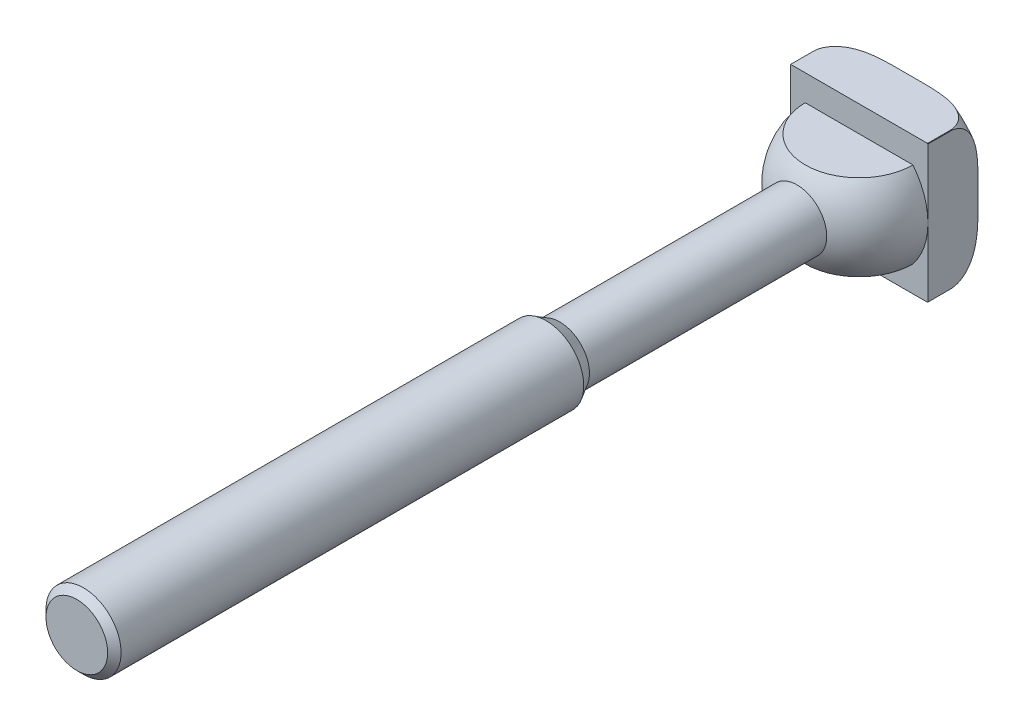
ISO-10303-21;
HEADER;
FILE_DESCRIPTION(('STEP AP214'),'2;1');
FILE_NAME('part.step','',(''),(''),'','','');
FILE_SCHEMA(('AUTOMOTIVE_DESIGN { 1 0 10303 214 1 1 1 1 }'));
ENDSEC;
DATA;
#1=APPLICATION_CONTEXT('core data for automotive mechanical design processes');
#2=APPLICATION_PROTOCOL_DEFINITION('international standard','automotive_design',2000,#1);
#3=PRODUCT_CONTEXT('',#1,'mechanical');
#4=PRODUCT('Part','Part','',(#3));
#5=PRODUCT_RELATED_PRODUCT_CATEGORY('part','',(#4));
#6=PRODUCT_DEFINITION_FORMATION('','',#4);
#7=PRODUCT_DEFINITION_CONTEXT('part definition',#1,'design');
#8=PRODUCT_DEFINITION('design','',#6,#7);
#9=PRODUCT_DEFINITION_SHAPE('','',#8);
#10=(LENGTH_UNIT() NAMED_UNIT(*) SI_UNIT(.MILLI.,.METRE.));
#11=(NAMED_UNIT(*) PLANE_ANGLE_UNIT() SI_UNIT($,.RADIAN.));
#12=(NAMED_UNIT(*) SI_UNIT($,.STERADIAN.) SOLID_ANGLE_UNIT());
#13=UNCERTAINTY_MEASURE_WITH_UNIT(LENGTH_MEASURE(1.E-05),#10,'distance_accuracy_value','');
#14=(GEOMETRIC_REPRESENTATION_CONTEXT(3) GLOBAL_UNCERTAINTY_ASSIGNED_CONTEXT((#13)) GLOBAL_UNIT_ASSIGNED_CONTEXT((#10,
#11,#12)) REPRESENTATION_CONTEXT('',''));
#15=CARTESIAN_POINT('',(0.,0.,0.));
#16=DIRECTION('',(0.,0.,1.));
#17=DIRECTION('',(1.,0.,0.));
#18=AXIS2_PLACEMENT_3D('',#15,#16,#17);
#19=CARTESIAN_POINT('',(0.,0.,-3.60000000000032));
#20=DIRECTION('',(0.,0.,-1.));
#21=DIRECTION('',(0.,-1.,0.));
#22=AXIS2_PLACEMENT_3D('',#19,#20,#21);
#23=TOROIDAL_SURFACE('',#22,11.1100000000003,4.39999999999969);
#24=CARTESIAN_POINT('',(-11.,0.,-7.9986247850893));
#25=CARTESIAN_POINT('',(-11.,-0.244167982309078,-7.99862566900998));
#26=CARTESIAN_POINT('',(-11.,-0.488335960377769,-7.99885116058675));
#27=CARTESIAN_POINT('',(-11.,-0.976671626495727,-7.99948190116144));
#28=CARTESIAN_POINT('',(-11.,-1.22083931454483,-7.9998871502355));
#29=CARTESIAN_POINT('',(-11.,-1.70936602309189,-8.00007526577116));
#30=CARTESIAN_POINT('',(-11.,-1.95372504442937,-7.99985764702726));
#31=CARTESIAN_POINT('',(-11.,-2.44244295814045,-7.99751713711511));
#32=CARTESIAN_POINT('',(-11.,-2.68680185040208,-7.9953942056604));
#33=CARTESIAN_POINT('',(-11.,-3.17540494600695,-7.98754889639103));
#34=CARTESIAN_POINT('',(-11.,-3.41964916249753,-7.98182749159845));
#35=CARTESIAN_POINT('',(-11.,-3.90794771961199,-7.96474581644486));
#36=CARTESIAN_POINT('',(-11.,-4.15200206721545,-7.95338576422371));
#37=CARTESIAN_POINT('',(-11.,-4.63930745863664,-7.92271306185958));
#38=CARTESIAN_POINT('',(-11.,-4.88255914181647,-7.90341115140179));
#39=CARTESIAN_POINT('',(-11.,-5.36808047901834,-7.85426911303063));
#40=CARTESIAN_POINT('',(-11.,-5.61034994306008,-7.82442703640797));
#41=CARTESIAN_POINT('',(-11.,-6.09743926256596,-7.75070651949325));
#42=CARTESIAN_POINT('',(-11.,-6.3422221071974,-7.70657606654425));
#43=CARTESIAN_POINT('',(-11.,-6.8280390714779,-7.60128676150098));
#44=CARTESIAN_POINT('',(-11.,-7.06907525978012,-7.54013768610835));
#45=CARTESIAN_POINT('',(-11.,-7.5440287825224,-7.39777029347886));
#46=CARTESIAN_POINT('',(-11.,-7.77797424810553,-7.31664763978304));
#47=CARTESIAN_POINT('',(-11.,-8.23621103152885,-7.13090753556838));
#48=CARTESIAN_POINT('',(-11.,-8.46051347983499,-7.02631808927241));
#49=CARTESIAN_POINT('',(-11.,-8.8893021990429,-6.79347114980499));
#50=CARTESIAN_POINT('',(-11.,-9.09414705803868,-6.66588219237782));
#51=CARTESIAN_POINT('',(-11.,-9.48435680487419,-6.38282448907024));
#52=CARTESIAN_POINT('',(-11.,-9.66970590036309,-6.22733341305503));
#53=CARTESIAN_POINT('',(-11.,-9.92764272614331,-5.97197598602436));
#54=CARTESIAN_POINT('',(-11.,-10.0107063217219,-5.8825714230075));
#55=CARTESIAN_POINT('',(-11.,-10.1684678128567,-5.69669341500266));
#56=CARTESIAN_POINT('',(-11.,-10.2431702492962,-5.60022385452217));
#57=CARTESIAN_POINT('',(-11.,-10.3828802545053,-5.40067661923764));
#58=CARTESIAN_POINT('',(-11.,-10.4479014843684,-5.29760855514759));
#59=CARTESIAN_POINT('',(-11.,-10.5670841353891,-5.08542919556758));
#60=CARTESIAN_POINT('',(-11.,-10.6212496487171,-4.97632019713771));
#61=CARTESIAN_POINT('',(-11.,-10.7405401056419,-4.69947224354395));
#62=CARTESIAN_POINT('',(-11.,-10.7985709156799,-4.52858953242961));
#63=CARTESIAN_POINT('',(-11.,-10.8850617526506,-4.17956065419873));
#64=CARTESIAN_POINT('',(-11.,-10.9135367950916,-4.00141822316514));
#65=CARTESIAN_POINT('',(-11.,-10.9392736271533,-3.64253555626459));
#66=CARTESIAN_POINT('',(-11.,-10.9364796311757,-3.46179125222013));
#67=CARTESIAN_POINT('',(-11.,-10.8997077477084,-3.1035156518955));
#68=CARTESIAN_POINT('',(-11.,-10.8657258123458,-2.92598477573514));
#69=CARTESIAN_POINT('',(-11.,-10.7697974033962,-2.58326250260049));
#70=CARTESIAN_POINT('',(-11.,-10.7085296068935,-2.41787879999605));
#71=CARTESIAN_POINT('',(-11.,-10.5614224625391,-2.09852829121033));
#72=CARTESIAN_POINT('',(-11.,-10.4755802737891,-1.9445628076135));
#73=CARTESIAN_POINT('',(-11.,-10.2740206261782,-1.63654089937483));
#74=CARTESIAN_POINT('',(-11.,-10.1562554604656,-1.48383203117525));
#75=CARTESIAN_POINT('',(-11.,-9.90072963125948,-1.19621722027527));
#76=CARTESIAN_POINT('',(-11.,-9.76295152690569,-1.06132700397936));
#77=CARTESIAN_POINT('',(-11.,-9.38652000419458,-0.735758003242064));
#78=CARTESIAN_POINT('',(-11.,-9.13606286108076,-0.558702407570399));
#79=CARTESIAN_POINT('',(-11.,-8.61050942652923,-0.246656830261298));
#80=CARTESIAN_POINT('',(-11.,-8.33537675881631,-0.111730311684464));
#81=CARTESIAN_POINT('',(-11.,-7.82006748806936,0.101266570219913));
#82=CARTESIAN_POINT('',(-11.,-7.58222898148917,0.185159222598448));
#83=CARTESIAN_POINT('',(-11.,-7.10003595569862,0.331865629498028));
#84=CARTESIAN_POINT('',(-11.,-6.85567647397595,0.394662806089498));
#85=CARTESIAN_POINT('',(-11.,-6.36219645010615,0.502824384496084));
#86=CARTESIAN_POINT('',(-11.,-6.11306070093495,0.54811758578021));
#87=CARTESIAN_POINT('',(-11.,-5.61276963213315,0.624275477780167));
#88=CARTESIAN_POINT('',(-11.,-5.36161522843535,0.655146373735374));
#89=CARTESIAN_POINT('',(-11.,-4.78187506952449,0.713294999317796));
#90=CARTESIAN_POINT('',(-11.,-4.45290899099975,0.736642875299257));
#91=CARTESIAN_POINT('',(-11.,-3.79428225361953,0.770498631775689));
#92=CARTESIAN_POINT('',(-11.,-3.46462137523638,0.781001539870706));
#93=CARTESIAN_POINT('',(-11.,-2.80475297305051,0.794523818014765));
#94=CARTESIAN_POINT('',(-11.,-2.47454529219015,0.797533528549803));
#95=CARTESIAN_POINT('',(-11.,-1.81418154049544,0.800324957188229));
#96=CARTESIAN_POINT('',(-11.,-1.48402546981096,0.800107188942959));
#97=CARTESIAN_POINT('',(-11.,-0.82393451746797,0.799332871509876));
#98=CARTESIAN_POINT('',(-11.,-0.493999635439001,0.798776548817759));
#99=CARTESIAN_POINT('',(-11.,0.165885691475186,0.798533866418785));
#100=CARTESIAN_POINT('',(-11.,0.495836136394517,0.798847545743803));
#101=CARTESIAN_POINT('',(-11.,1.15553605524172,0.79973197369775));
#102=CARTESIAN_POINT('',(-11.,1.48528553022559,0.800302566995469));
#103=CARTESIAN_POINT('',(-11.,2.1447765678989,0.799356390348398));
#104=CARTESIAN_POINT('',(-11.,2.47451813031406,0.797839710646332));
#105=CARTESIAN_POINT('',(-11.,3.04438053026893,0.790080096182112));
#106=CARTESIAN_POINT('',(-11.,3.28451680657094,0.785232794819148));
#107=CARTESIAN_POINT('',(-11.,3.76466882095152,0.770480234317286));
#108=CARTESIAN_POINT('',(-11.,4.00468454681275,0.760574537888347));
#109=CARTESIAN_POINT('',(-11.,4.48464487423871,0.733525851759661));
#110=CARTESIAN_POINT('',(-11.,4.72458897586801,0.716373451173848));
#111=CARTESIAN_POINT('',(-11.,5.20361397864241,0.672406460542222));
#112=CARTESIAN_POINT('',(-11.,5.44269491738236,0.645592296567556));
#113=CARTESIAN_POINT('',(-11.,5.92237388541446,0.579216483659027));
#114=CARTESIAN_POINT('',(-11.,6.16294979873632,0.539490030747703));
#115=CARTESIAN_POINT('',(-11.,6.64113749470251,0.444417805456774));
#116=CARTESIAN_POINT('',(-11.,6.87874845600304,0.389067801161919));
#117=CARTESIAN_POINT('',(-11.,7.34813652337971,0.259819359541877));
#118=CARTESIAN_POINT('',(-11.,7.57993016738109,0.185982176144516));
#119=CARTESIAN_POINT('',(-11.,8.0353842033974,0.0165125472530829));
#120=CARTESIAN_POINT('',(-11.,8.25904986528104,-0.0791054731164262));
#121=CARTESIAN_POINT('',(-11.,8.70040739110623,-0.298322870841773));
#122=CARTESIAN_POINT('',(-11.,8.91774655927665,-0.422642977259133));
#123=CARTESIAN_POINT('',(-11.,9.33339082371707,-0.700649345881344));
#124=CARTESIAN_POINT('',(-11.,9.53169018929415,-0.854344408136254));
#125=CARTESIAN_POINT('',(-11.,9.80930539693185,-1.10870064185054));
#126=CARTESIAN_POINT('',(-11.,9.89904640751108,-1.19810417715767));
#127=CARTESIAN_POINT('',(-11.,10.0700814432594,-1.38462017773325));
#128=CARTESIAN_POINT('',(-11.,10.1513803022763,-1.48172817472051));
#129=CARTESIAN_POINT('',(-11.,10.3040772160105,-1.68326064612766));
#130=CARTESIAN_POINT('',(-11.,10.3754890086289,-1.78767465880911));
#131=CARTESIAN_POINT('',(-11.,10.5070935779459,-2.00328733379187));
#132=CARTESIAN_POINT('',(-11.,10.5672911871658,-2.11448304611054));
#133=CARTESIAN_POINT('',(-11.,10.6985537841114,-2.39251409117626));
#134=CARTESIAN_POINT('',(-11.,10.76299986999,-2.56255583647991));
#135=CARTESIAN_POINT('',(-11.,10.862440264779,-2.91098018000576));
#136=CARTESIAN_POINT('',(-11.,10.8974518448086,-3.08935782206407));
#137=CARTESIAN_POINT('',(-11.,10.9360122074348,-3.44995476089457));
#138=CARTESIAN_POINT('',(-11.,10.9394870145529,-3.63218208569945));
#139=CARTESIAN_POINT('',(-11.,10.9145419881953,-3.99443117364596));
#140=CARTESIAN_POINT('',(-11.,10.8861197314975,-4.17445276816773));
#141=CARTESIAN_POINT('',(-11.,10.8006529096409,-4.52098257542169));
#142=CARTESIAN_POINT('',(-11.,10.7446134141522,-4.68774209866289));
#143=CARTESIAN_POINT('',(-11.,10.6074145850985,-5.01050120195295));
#144=CARTESIAN_POINT('',(-11.,10.5262513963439,-5.16649912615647));
#145=CARTESIAN_POINT('',(-11.,10.3348573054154,-5.47752748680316));
#146=CARTESIAN_POINT('',(-11.,10.2227798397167,-5.63141482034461));
#147=CARTESIAN_POINT('',(-11.,9.97826988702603,-5.92196783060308));
#148=CARTESIAN_POINT('',(-11.,9.84582459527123,-6.05862257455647));
#149=CARTESIAN_POINT('',(-11.,9.48633467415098,-6.38591323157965));
#150=CARTESIAN_POINT('',(-11.,9.24782164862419,-6.56397460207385));
#151=CARTESIAN_POINT('',(-11.,8.74555737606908,-6.87988293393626));
#152=CARTESIAN_POINT('',(-11.,8.48175205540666,-7.01764106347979));
#153=CARTESIAN_POINT('',(-11.,7.9912674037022,-7.23459728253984));
#154=CARTESIAN_POINT('',(-11.,7.76724215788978,-7.31996551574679));
#155=CARTESIAN_POINT('',(-11.,7.31248611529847,-7.47076953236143));
#156=CARTESIAN_POINT('',(-11.,7.08175056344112,-7.53619078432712));
#157=CARTESIAN_POINT('',(-11.,6.61580785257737,-7.65016374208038));
#158=CARTESIAN_POINT('',(-11.,6.38059348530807,-7.69868530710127));
#159=CARTESIAN_POINT('',(-11.,5.90765678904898,-7.78166493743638));
#160=CARTESIAN_POINT('',(-11.,5.66993347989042,-7.81611728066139));
#161=CARTESIAN_POINT('',(-11.,5.20678918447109,-7.87205097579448));
#162=CARTESIAN_POINT('',(-11.,4.98144154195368,-7.89416108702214));
#163=CARTESIAN_POINT('',(-11.,4.53016547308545,-7.93045973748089));
#164=CARTESIAN_POINT('',(-11.,4.30423713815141,-7.94464945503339));
#165=CARTESIAN_POINT('',(-11.,3.85190033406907,-7.96709033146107));
#166=CARTESIAN_POINT('',(-11.,3.62549161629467,-7.97533617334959));
#167=CARTESIAN_POINT('',(-11.,3.17256308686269,-7.98764124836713));
#168=CARTESIAN_POINT('',(-11.,2.94604327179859,-7.99170034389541));
#169=CARTESIAN_POINT('',(-11.,2.49282649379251,-7.99717570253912));
#170=CARTESIAN_POINT('',(-11.,2.26612951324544,-7.99859020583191));
#171=CARTESIAN_POINT('',(-11.,1.81273701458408,-8.00004599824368));
#172=CARTESIAN_POINT('',(-11.,1.58604149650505,-8.00008730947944));
#173=CARTESIAN_POINT('',(-11.,1.13278850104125,-7.99975527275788));
#174=CARTESIAN_POINT('',(-11.,0.906231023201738,-7.99938217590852));
#175=CARTESIAN_POINT('',(-11.,0.453115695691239,-7.99881652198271));
#176=CARTESIAN_POINT('',(-11.,0.226557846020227,-7.99862396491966));
#177=CARTESIAN_POINT('',(-11.,0.,-7.9986247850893));
#178=B_SPLINE_CURVE_WITH_KNOTS('',3,(#24,#25,#26,#27,#28,#29,#30,#31,#32,#33,#34,#35,#36,#37,
#38,#39,#40,#41,#42,#43,#44,#45,#46,#47,#48,#49,#50,#51,#52,#53,#54,#55,#56,#57,#58,#59,#60,#61,
#62,#63,#64,#65,#66,#67,#68,#69,#70,#71,#72,#73,#74,#75,#76,#77,#78,#79,#80,#81,#82,#83,#84,#85,
#86,#87,#88,#89,#90,#91,#92,#93,#94,#95,#96,#97,#98,#99,#100,#101,#102,#103,#104,#105,#106,#107,
#108,#109,#110,#111,#112,#113,#114,#115,#116,#117,#118,#119,#120,#121,#122,#123,#124,#125,#126,
#127,#128,#129,#130,#131,#132,#133,#134,#135,#136,#137,#138,#139,#140,#141,#142,#143,#144,#145,
#146,#147,#148,#149,#150,#151,#152,#153,#154,#155,#156,#157,#158,#159,#160,#161,#162,#163,#164,
#165,#166,#167,#168,#169,#170,#171,#172,#173,#174,#175,#176,#177),.UNSPECIFIED.,.T.,.F.,(4,2,2,
2,2,2,2,2,2,2,2,2,2,2,2,2,2,2,2,2,2,2,2,2,2,2,2,2,2,2,2,2,2,2,2,2,2,2,2,2,2,2,2,2,2,2,2,2,2,2,2,
2,2,2,2,2,2,2,2,2,2,2,2,2,2,2,2,2,2,2,2,2,2,2,2,2,4),(0.,0.732503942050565,1.46500819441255,
2.19808321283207,2.9311737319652,3.66406610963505,4.39693013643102,5.12880635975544,
5.86081796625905,6.60651638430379,7.35178730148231,8.09355590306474,8.83444397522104,
9.55651629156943,10.2791690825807,10.6448684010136,11.0103681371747,11.3753471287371,
11.7401882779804,12.279036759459,12.8176113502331,13.3571469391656,13.8967525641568,
14.423627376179,14.9505631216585,15.5269516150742,16.1038454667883,17.0187682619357,
17.9350627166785,18.6905663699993,19.446662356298,20.2058023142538,20.9646153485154,
21.9535833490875,22.9429340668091,23.933559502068,24.9240272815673,25.9138331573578,
26.9036834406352,27.8929360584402,28.8821459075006,29.602668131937,30.3232526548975,
31.0447758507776,31.7662672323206,32.4973547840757,33.2286405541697,33.9575346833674,
34.6859474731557,35.4351499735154,36.1845772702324,36.5641726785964,36.9435495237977,
37.3223938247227,37.7010744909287,38.2440729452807,38.7867525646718,39.3307048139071,
39.8746983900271,40.4002130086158,40.9258083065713,41.4947952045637,42.06414128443,
42.9520282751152,43.8418577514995,44.5600475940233,45.2787593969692,45.9987465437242,
46.7190262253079,47.3981425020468,48.0771577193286,48.7567795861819,49.4364237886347,
50.1165200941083,50.7966054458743,51.4762789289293,52.155952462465),.UNSPECIFIED.);
#179=CARTESIAN_POINT('',(-11.,-1.55951915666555,-8.));
#180=VERTEX_POINT('',#179);
#181=CARTESIAN_POINT('',(-11.,-10.9343541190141,-3.6));
#182=VERTEX_POINT('',#181);
#183=EDGE_CURVE('E264',#180,#182,#178,.T.);
#184=ORIENTED_EDGE('',*,*,#183,.F.);
#185=CARTESIAN_POINT('',(0.,0.,-8.));
#186=DIRECTION('',(0.,0.,-1.));
#187=DIRECTION('',(0.,-1.,0.));
#188=AXIS2_PLACEMENT_3D('',#185,#186,#187);
#189=CIRCLE('',#188,11.11);
#190=CARTESIAN_POINT('',(-1.55951915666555,-11.,-8.));
#191=VERTEX_POINT('',#190);
#192=EDGE_CURVE('E267',#191,#180,#189,.T.);
#193=ORIENTED_EDGE('',*,*,#192,.F.);
#194=CARTESIAN_POINT('',(0.,-11.,-7.9986247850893));
#195=CARTESIAN_POINT('',(0.244167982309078,-11.,-7.99862566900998));
#196=CARTESIAN_POINT('',(0.488335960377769,-11.,-7.99885116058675));
#197=CARTESIAN_POINT('',(0.976671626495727,-11.,-7.99948190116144));
#198=CARTESIAN_POINT('',(1.22083931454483,-11.,-7.9998871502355));
#199=CARTESIAN_POINT('',(1.70936602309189,-11.,-8.00007526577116));
#200=CARTESIAN_POINT('',(1.95372504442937,-11.,-7.99985764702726));
#201=CARTESIAN_POINT('',(2.44244295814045,-11.,-7.99751713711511));
#202=CARTESIAN_POINT('',(2.68680185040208,-11.,-7.9953942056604));
#203=CARTESIAN_POINT('',(3.17540494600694,-11.,-7.98754889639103));
#204=CARTESIAN_POINT('',(3.41964916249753,-11.,-7.98182749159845));
#205=CARTESIAN_POINT('',(3.90794771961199,-11.,-7.96474581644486));
#206=CARTESIAN_POINT('',(4.15200206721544,-11.,-7.95338576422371));
#207=CARTESIAN_POINT('',(4.63930745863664,-11.,-7.92271306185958));
#208=CARTESIAN_POINT('',(4.88255914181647,-11.,-7.90341115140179));
#209=CARTESIAN_POINT('',(5.36808047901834,-11.,-7.85426911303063));
#210=CARTESIAN_POINT('',(5.61034994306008,-11.,-7.82442703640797));
#211=CARTESIAN_POINT('',(6.09743926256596,-11.,-7.75070651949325));
#212=CARTESIAN_POINT('',(6.3422221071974,-11.,-7.70657606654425));
#213=CARTESIAN_POINT('',(6.8280390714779,-11.,-7.60128676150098));
#214=CARTESIAN_POINT('',(7.06907525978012,-11.,-7.54013768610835));
#215=CARTESIAN_POINT('',(7.5440287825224,-11.,-7.39777029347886));
#216=CARTESIAN_POINT('',(7.77797424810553,-11.,-7.31664763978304));
#217=CARTESIAN_POINT('',(8.23621103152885,-11.,-7.13090753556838));
#218=CARTESIAN_POINT('',(8.46051347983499,-11.,-7.02631808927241));
#219=CARTESIAN_POINT('',(8.8893021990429,-11.,-6.79347114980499));
#220=CARTESIAN_POINT('',(9.09414705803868,-11.,-6.66588219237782));
#221=CARTESIAN_POINT('',(9.48435680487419,-11.,-6.38282448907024));
#222=CARTESIAN_POINT('',(9.66970590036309,-11.,-6.22733341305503));
#223=CARTESIAN_POINT('',(9.92764272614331,-11.,-5.97197598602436));
#224=CARTESIAN_POINT('',(10.0107063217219,-11.,-5.8825714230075));
#225=CARTESIAN_POINT('',(10.1684678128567,-11.,-5.69669341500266));
#226=CARTESIAN_POINT('',(10.2431702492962,-11.,-5.60022385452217));
#227=CARTESIAN_POINT('',(10.3828802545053,-11.,-5.40067661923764));
#228=CARTESIAN_POINT('',(10.4479014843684,-11.,-5.29760855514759));
#229=CARTESIAN_POINT('',(10.5670841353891,-11.,-5.08542919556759));
#230=CARTESIAN_POINT('',(10.6212496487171,-11.,-4.97632019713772));
#231=CARTESIAN_POINT('',(10.7405401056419,-11.,-4.69947224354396));
#232=CARTESIAN_POINT('',(10.7985709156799,-11.,-4.52858953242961));
#233=CARTESIAN_POINT('',(10.8850617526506,-11.,-4.17956065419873));
#234=CARTESIAN_POINT('',(10.9135367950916,-11.,-4.00141822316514));
#235=CARTESIAN_POINT('',(10.9392736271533,-11.,-3.64253555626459));
#236=CARTESIAN_POINT('',(10.9364796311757,-11.,-3.46179125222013));
#237=CARTESIAN_POINT('',(10.8997077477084,-11.,-3.1035156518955));
#238=CARTESIAN_POINT('',(10.8657258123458,-11.,-2.92598477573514));
#239=CARTESIAN_POINT('',(10.7697974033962,-11.,-2.58326250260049));
#240=CARTESIAN_POINT('',(10.7085296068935,-11.,-2.41787879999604));
#241=CARTESIAN_POINT('',(10.5614224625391,-11.,-2.09852829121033));
#242=CARTESIAN_POINT('',(10.4755802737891,-11.,-1.9445628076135));
#243=CARTESIAN_POINT('',(10.2740206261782,-11.,-1.63654089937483));
#244=CARTESIAN_POINT('',(10.1562554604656,-11.,-1.48383203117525));
#245=CARTESIAN_POINT('',(9.90072963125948,-11.,-1.19621722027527));
#246=CARTESIAN_POINT('',(9.76295152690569,-11.,-1.06132700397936));
#247=CARTESIAN_POINT('',(9.38652000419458,-11.,-0.735758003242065));
#248=CARTESIAN_POINT('',(9.13606286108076,-11.,-0.558702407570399));
#249=CARTESIAN_POINT('',(8.61050942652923,-11.,-0.246656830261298));
#250=CARTESIAN_POINT('',(8.33537675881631,-11.,-0.111730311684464));
#251=CARTESIAN_POINT('',(7.82006748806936,-11.,0.101266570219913));
#252=CARTESIAN_POINT('',(7.58222898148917,-11.,0.185159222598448));
#253=CARTESIAN_POINT('',(7.10003595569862,-11.,0.331865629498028));
#254=CARTESIAN_POINT('',(6.85567647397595,-11.,0.394662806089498));
#255=CARTESIAN_POINT('',(6.36219645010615,-11.,0.502824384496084));
#256=CARTESIAN_POINT('',(6.11306070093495,-11.,0.54811758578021));
#257=CARTESIAN_POINT('',(5.61276963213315,-11.,0.624275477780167));
#258=CARTESIAN_POINT('',(5.36161522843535,-11.,0.655146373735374));
#259=CARTESIAN_POINT('',(4.78187506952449,-11.,0.713294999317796));
#260=CARTESIAN_POINT('',(4.45290899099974,-11.,0.736642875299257));
#261=CARTESIAN_POINT('',(3.79428225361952,-11.,0.770498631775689));
#262=CARTESIAN_POINT('',(3.46462137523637,-11.,0.781001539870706));
#263=CARTESIAN_POINT('',(2.8047529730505,-11.,0.794523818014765));
#264=CARTESIAN_POINT('',(2.47454529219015,-11.,0.797533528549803));
#265=CARTESIAN_POINT('',(1.81418154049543,-11.,0.800324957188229));
#266=CARTESIAN_POINT('',(1.48402546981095,-11.,0.800107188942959));
#267=CARTESIAN_POINT('',(0.823934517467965,-11.,0.799332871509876));
#268=CARTESIAN_POINT('',(0.493999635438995,-11.,0.798776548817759));
#269=CARTESIAN_POINT('',(-0.16588569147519,-11.,0.798533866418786));
#270=CARTESIAN_POINT('',(-0.49583613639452,-11.,0.798847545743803));
#271=CARTESIAN_POINT('',(-1.15553605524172,-11.,0.79973197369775));
#272=CARTESIAN_POINT('',(-1.4852855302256,-11.,0.800302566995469));
#273=CARTESIAN_POINT('',(-2.1447765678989,-11.,0.799356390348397));
#274=CARTESIAN_POINT('',(-2.47451813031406,-11.,0.797839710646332));
#275=CARTESIAN_POINT('',(-3.04438053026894,-11.,0.790080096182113));
#276=CARTESIAN_POINT('',(-3.28451680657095,-11.,0.785232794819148));
#277=CARTESIAN_POINT('',(-3.76466882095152,-11.,0.770480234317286));
#278=CARTESIAN_POINT('',(-4.00468454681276,-11.,0.760574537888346));
#279=CARTESIAN_POINT('',(-4.48464487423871,-11.,0.733525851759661));
#280=CARTESIAN_POINT('',(-4.72458897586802,-11.,0.716373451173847));
#281=CARTESIAN_POINT('',(-5.20361397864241,-11.,0.672406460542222));
#282=CARTESIAN_POINT('',(-5.44269491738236,-11.,0.645592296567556));
#283=CARTESIAN_POINT('',(-5.92237388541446,-11.,0.579216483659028));
#284=CARTESIAN_POINT('',(-6.16294979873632,-11.,0.539490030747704));
#285=CARTESIAN_POINT('',(-6.6411374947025,-11.,0.444417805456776));
#286=CARTESIAN_POINT('',(-6.87874845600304,-11.,0.38906780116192));
#287=CARTESIAN_POINT('',(-7.34813652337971,-11.,0.25981935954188));
#288=CARTESIAN_POINT('',(-7.57993016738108,-11.,0.185982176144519));
#289=CARTESIAN_POINT('',(-8.0353842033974,-11.,0.0165125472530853));
#290=CARTESIAN_POINT('',(-8.25904986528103,-11.,-0.0791054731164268));
#291=CARTESIAN_POINT('',(-8.70040739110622,-11.,-0.298322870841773));
#292=CARTESIAN_POINT('',(-8.91774655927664,-11.,-0.42264297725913));
#293=CARTESIAN_POINT('',(-9.33339082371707,-11.,-0.700649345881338));
#294=CARTESIAN_POINT('',(-9.53169018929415,-11.,-0.854344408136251));
#295=CARTESIAN_POINT('',(-9.80930539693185,-11.,-1.10870064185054));
#296=CARTESIAN_POINT('',(-9.89904640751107,-11.,-1.19810417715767));
#297=CARTESIAN_POINT('',(-10.0700814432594,-11.,-1.38462017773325));
#298=CARTESIAN_POINT('',(-10.1513803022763,-11.,-1.48172817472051));
#299=CARTESIAN_POINT('',(-10.3040772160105,-11.,-1.68326064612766));
#300=CARTESIAN_POINT('',(-10.3754890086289,-11.,-1.78767465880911));
#301=CARTESIAN_POINT('',(-10.5070935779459,-11.,-2.00328733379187));
#302=CARTESIAN_POINT('',(-10.5672911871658,-11.,-2.11448304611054));
#303=CARTESIAN_POINT('',(-10.6985537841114,-11.,-2.39251409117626));
#304=CARTESIAN_POINT('',(-10.76299986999,-11.,-2.56255583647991));
#305=CARTESIAN_POINT('',(-10.862440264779,-11.,-2.91098018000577));
#306=CARTESIAN_POINT('',(-10.8974518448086,-11.,-3.08935782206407));
#307=CARTESIAN_POINT('',(-10.9360122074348,-11.,-3.44995476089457));
#308=CARTESIAN_POINT('',(-10.9394870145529,-11.,-3.63218208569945));
#309=CARTESIAN_POINT('',(-10.9145419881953,-11.,-3.99443117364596));
#310=CARTESIAN_POINT('',(-10.8861197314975,-11.,-4.17445276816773));
#311=CARTESIAN_POINT('',(-10.8006529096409,-11.,-4.52098257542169));
#312=CARTESIAN_POINT('',(-10.7446134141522,-11.,-4.68774209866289));
#313=CARTESIAN_POINT('',(-10.6074145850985,-11.,-5.01050120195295));
#314=CARTESIAN_POINT('',(-10.5262513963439,-11.,-5.16649912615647));
#315=CARTESIAN_POINT('',(-10.3348573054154,-11.,-5.47752748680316));
#316=CARTESIAN_POINT('',(-10.2227798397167,-11.,-5.63141482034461));
#317=CARTESIAN_POINT('',(-9.97826988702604,-11.,-5.92196783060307));
#318=CARTESIAN_POINT('',(-9.84582459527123,-11.,-6.05862257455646));
#319=CARTESIAN_POINT('',(-9.48633467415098,-11.,-6.38591323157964));
#320=CARTESIAN_POINT('',(-9.24782164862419,-11.,-6.56397460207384));
#321=CARTESIAN_POINT('',(-8.74555737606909,-11.,-6.87988293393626));
#322=CARTESIAN_POINT('',(-8.48175205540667,-11.,-7.0176410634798));
#323=CARTESIAN_POINT('',(-7.99126740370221,-11.,-7.23459728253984));
#324=CARTESIAN_POINT('',(-7.76724215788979,-11.,-7.31996551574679));
#325=CARTESIAN_POINT('',(-7.31248611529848,-11.,-7.47076953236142));
#326=CARTESIAN_POINT('',(-7.08175056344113,-11.,-7.53619078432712));
#327=CARTESIAN_POINT('',(-6.61580785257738,-11.,-7.65016374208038));
#328=CARTESIAN_POINT('',(-6.38059348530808,-11.,-7.69868530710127));
#329=CARTESIAN_POINT('',(-5.90765678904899,-11.,-7.78166493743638));
#330=CARTESIAN_POINT('',(-5.66993347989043,-11.,-7.81611728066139));
#331=CARTESIAN_POINT('',(-5.2067891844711,-11.,-7.87205097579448));
#332=CARTESIAN_POINT('',(-4.9814415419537,-11.,-7.89416108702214));
#333=CARTESIAN_POINT('',(-4.53016547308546,-11.,-7.93045973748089));
#334=CARTESIAN_POINT('',(-4.30423713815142,-11.,-7.94464945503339));
#335=CARTESIAN_POINT('',(-3.85190033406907,-11.,-7.96709033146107));
#336=CARTESIAN_POINT('',(-3.62549161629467,-11.,-7.97533617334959));
#337=CARTESIAN_POINT('',(-3.17256308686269,-11.,-7.98764124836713));
#338=CARTESIAN_POINT('',(-2.94604327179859,-11.,-7.99170034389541));
#339=CARTESIAN_POINT('',(-2.49282649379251,-11.,-7.99717570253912));
#340=CARTESIAN_POINT('',(-2.26612951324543,-11.,-7.99859020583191));
#341=CARTESIAN_POINT('',(-1.81273701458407,-11.,-8.00004599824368));
#342=CARTESIAN_POINT('',(-1.58604149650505,-11.,-8.00008730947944));
#343=CARTESIAN_POINT('',(-1.13278850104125,-11.,-7.99975527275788));
#344=CARTESIAN_POINT('',(-0.906231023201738,-11.,-7.99938217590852));
#345=CARTESIAN_POINT('',(-0.45311569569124,-11.,-7.99881652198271));
#346=CARTESIAN_POINT('',(-0.226557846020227,-11.,-7.99862396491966));
#347=CARTESIAN_POINT('',(0.,-11.,-7.9986247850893));
#348=B_SPLINE_CURVE_WITH_KNOTS('',3,(#194,#195,#196,#197,#198,#199,#200,#201,#202,#203,#204,
#205,#206,#207,#208,#209,#210,#211,#212,#213,#214,#215,#216,#217,#218,#219,#220,#221,#222,#223,
#224,#225,#226,#227,#228,#229,#230,#231,#232,#233,#234,#235,#236,#237,#238,#239,#240,#241,#242,
#243,#244,#245,#246,#247,#248,#249,#250,#251,#252,#253,#254,#255,#256,#257,#258,#259,#260,#261,
#262,#263,#264,#265,#266,#267,#268,#269,#270,#271,#272,#273,#274,#275,#276,#277,#278,#279,#280,
#281,#282,#283,#284,#285,#286,#287,#288,#289,#290,#291,#292,#293,#294,#295,#296,#297,#298,#299,
#300,#301,#302,#303,#304,#305,#306,#307,#308,#309,#310,#311,#312,#313,#314,#315,#316,#317,#318,
#319,#320,#321,#322,#323,#324,#325,#326,#327,#328,#329,#330,#331,#332,#333,#334,#335,#336,#337,
#338,#339,#340,#341,#342,#343,#344,#345,#346,#347),.UNSPECIFIED.,.T.,.F.,(4,2,2,2,2,2,2,2,2,2,2,
2,2,2,2,2,2,2,2,2,2,2,2,2,2,2,2,2,2,2,2,2,2,2,2,2,2,2,2,2,2,2,2,2,2,2,2,2,2,2,2,2,2,2,2,2,2,2,2,
2,2,2,2,2,2,2,2,2,2,2,2,2,2,2,2,2,4),(0.,0.732503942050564,1.46500819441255,2.19808321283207,
2.9311737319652,3.66406610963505,4.39693013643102,5.12880635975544,5.86081796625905,
6.60651638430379,7.35178730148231,8.09355590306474,8.83444397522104,9.55651629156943,
10.2791690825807,10.6448684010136,11.0103681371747,11.3753471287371,11.7401882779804,
12.279036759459,12.8176113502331,13.3571469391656,13.8967525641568,14.423627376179,
14.9505631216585,15.5269516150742,16.1038454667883,17.0187682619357,17.9350627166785,
18.6905663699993,19.446662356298,20.2058023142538,20.9646153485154,21.9535833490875,
22.9429340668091,23.933559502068,24.9240272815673,25.9138331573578,26.9036834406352,
27.8929360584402,28.8821459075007,29.602668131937,30.3232526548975,31.0447758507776,
31.7662672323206,32.4973547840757,33.2286405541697,33.9575346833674,34.6859474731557,
35.4351499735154,36.1845772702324,36.5641726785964,36.9435495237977,37.3223938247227,
37.7010744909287,38.2440729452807,38.7867525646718,39.3307048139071,39.8746983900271,
40.4002130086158,40.9258083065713,41.4947952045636,42.06414128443,42.9520282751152,
43.8418577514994,44.5600475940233,45.2787593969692,45.9987465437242,46.7190262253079,
47.3981425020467,48.0771577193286,48.7567795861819,49.4364237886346,50.1165200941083,
50.7966054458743,51.4762789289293,52.155952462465),.UNSPECIFIED.);
#349=CARTESIAN_POINT('',(-10.9343541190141,-11.,-3.6));
#350=VERTEX_POINT('',#349);
#351=EDGE_CURVE('E310',#350,#191,#348,.T.);
#352=ORIENTED_EDGE('',*,*,#351,.F.);
#353=CARTESIAN_POINT('',(0.,0.,-3.6));
#354=DIRECTION('',(0.,0.,-1.));
#355=DIRECTION('',(0.,-1.,0.));
#356=AXIS2_PLACEMENT_3D('',#353,#354,#355);
#357=CIRCLE('',#356,15.51);
#358=EDGE_CURVE('E167',#350,#182,#357,.T.);
#359=ORIENTED_EDGE('',*,*,#358,.T.);
#360=EDGE_LOOP('',(#184,#193,#352,#359));
#361=FACE_BOUND('',#360,.T.);
#362=ADVANCED_FACE('F14',(#361),#23,.T.);
#363=CARTESIAN_POINT('',(-11.,10.9343541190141,-3.6));
#364=VERTEX_POINT('',#363);
#365=CARTESIAN_POINT('',(-11.,1.55951915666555,-8.));
#366=VERTEX_POINT('',#365);
#367=EDGE_CURVE('E271',#364,#366,#178,.T.);
#368=ORIENTED_EDGE('',*,*,#367,.F.);
#369=CARTESIAN_POINT('',(-10.9343541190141,11.,-3.6));
#370=VERTEX_POINT('',#369);
#371=EDGE_CURVE('E290',#364,#370,#357,.T.);
#372=ORIENTED_EDGE('',*,*,#371,.T.);
#373=CARTESIAN_POINT('',(0.,11.,-7.9986247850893));
#374=CARTESIAN_POINT('',(-0.244167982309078,11.,-7.99862566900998));
#375=CARTESIAN_POINT('',(-0.488335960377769,11.,-7.99885116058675));
#376=CARTESIAN_POINT('',(-0.976671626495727,11.,-7.99948190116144));
#377=CARTESIAN_POINT('',(-1.22083931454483,11.,-7.9998871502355));
#378=CARTESIAN_POINT('',(-1.70936602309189,11.,-8.00007526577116));
#379=CARTESIAN_POINT('',(-1.95372504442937,11.,-7.99985764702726));
#380=CARTESIAN_POINT('',(-2.44244295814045,11.,-7.99751713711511));
#381=CARTESIAN_POINT('',(-2.68680185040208,11.,-7.9953942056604));
#382=CARTESIAN_POINT('',(-3.17540494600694,11.,-7.98754889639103));
#383=CARTESIAN_POINT('',(-3.41964916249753,11.,-7.98182749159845));
#384=CARTESIAN_POINT('',(-3.90794771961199,11.,-7.96474581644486));
#385=CARTESIAN_POINT('',(-4.15200206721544,11.,-7.95338576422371));
#386=CARTESIAN_POINT('',(-4.63930745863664,11.,-7.92271306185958));
#387=CARTESIAN_POINT('',(-4.88255914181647,11.,-7.90341115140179));
#388=CARTESIAN_POINT('',(-5.36808047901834,11.,-7.85426911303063));
#389=CARTESIAN_POINT('',(-5.61034994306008,11.,-7.82442703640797));
#390=CARTESIAN_POINT('',(-6.09743926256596,11.,-7.75070651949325));
#391=CARTESIAN_POINT('',(-6.3422221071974,11.,-7.70657606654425));
#392=CARTESIAN_POINT('',(-6.8280390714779,11.,-7.60128676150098));
#393=CARTESIAN_POINT('',(-7.06907525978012,11.,-7.54013768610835));
#394=CARTESIAN_POINT('',(-7.5440287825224,11.,-7.39777029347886));
#395=CARTESIAN_POINT('',(-7.77797424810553,11.,-7.31664763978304));
#396=CARTESIAN_POINT('',(-8.23621103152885,11.,-7.13090753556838));
#397=CARTESIAN_POINT('',(-8.46051347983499,11.,-7.02631808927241));
#398=CARTESIAN_POINT('',(-8.8893021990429,11.,-6.79347114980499));
#399=CARTESIAN_POINT('',(-9.09414705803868,11.,-6.66588219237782));
#400=CARTESIAN_POINT('',(-9.48435680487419,11.,-6.38282448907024));
#401=CARTESIAN_POINT('',(-9.66970590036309,11.,-6.22733341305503));
#402=CARTESIAN_POINT('',(-9.92764272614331,11.,-5.97197598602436));
#403=CARTESIAN_POINT('',(-10.0107063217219,11.,-5.8825714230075));
#404=CARTESIAN_POINT('',(-10.1684678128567,11.,-5.69669341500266));
#405=CARTESIAN_POINT('',(-10.2431702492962,11.,-5.60022385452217));
#406=CARTESIAN_POINT('',(-10.3828802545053,11.,-5.40067661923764));
#407=CARTESIAN_POINT('',(-10.4479014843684,11.,-5.29760855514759));
#408=CARTESIAN_POINT('',(-10.5670841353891,11.,-5.08542919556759));
#409=CARTESIAN_POINT('',(-10.6212496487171,11.,-4.97632019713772));
#410=CARTESIAN_POINT('',(-10.7405401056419,11.,-4.69947224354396));
#411=CARTESIAN_POINT('',(-10.7985709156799,11.,-4.52858953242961));
#412=CARTESIAN_POINT('',(-10.8850617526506,11.,-4.17956065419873));
#413=CARTESIAN_POINT('',(-10.9135367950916,11.,-4.00141822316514));
#414=CARTESIAN_POINT('',(-10.9392736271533,11.,-3.64253555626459));
#415=CARTESIAN_POINT('',(-10.9364796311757,11.,-3.46179125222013));
#416=CARTESIAN_POINT('',(-10.8997077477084,11.,-3.1035156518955));
#417=CARTESIAN_POINT('',(-10.8657258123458,11.,-2.92598477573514));
#418=CARTESIAN_POINT('',(-10.7697974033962,11.,-2.58326250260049));
#419=CARTESIAN_POINT('',(-10.7085296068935,11.,-2.41787879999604));
#420=CARTESIAN_POINT('',(-10.5614224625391,11.,-2.09852829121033));
#421=CARTESIAN_POINT('',(-10.4755802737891,11.,-1.9445628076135));
#422=CARTESIAN_POINT('',(-10.2740206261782,11.,-1.63654089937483));
#423=CARTESIAN_POINT('',(-10.1562554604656,11.,-1.48383203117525));
#424=CARTESIAN_POINT('',(-9.90072963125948,11.,-1.19621722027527));
#425=CARTESIAN_POINT('',(-9.76295152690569,11.,-1.06132700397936));
#426=CARTESIAN_POINT('',(-9.38652000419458,11.,-0.735758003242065));
#427=CARTESIAN_POINT('',(-9.13606286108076,11.,-0.558702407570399));
#428=CARTESIAN_POINT('',(-8.61050942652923,11.,-0.246656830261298));
#429=CARTESIAN_POINT('',(-8.33537675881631,11.,-0.111730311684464));
#430=CARTESIAN_POINT('',(-7.82006748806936,11.,0.101266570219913));
#431=CARTESIAN_POINT('',(-7.58222898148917,11.,0.185159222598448));
#432=CARTESIAN_POINT('',(-7.10003595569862,11.,0.331865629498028));
#433=CARTESIAN_POINT('',(-6.85567647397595,11.,0.394662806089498));
#434=CARTESIAN_POINT('',(-6.36219645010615,11.,0.502824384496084));
#435=CARTESIAN_POINT('',(-6.11306070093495,11.,0.54811758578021));
#436=CARTESIAN_POINT('',(-5.61276963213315,11.,0.624275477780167));
#437=CARTESIAN_POINT('',(-5.36161522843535,11.,0.655146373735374));
#438=CARTESIAN_POINT('',(-4.78187506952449,11.,0.713294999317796));
#439=CARTESIAN_POINT('',(-4.45290899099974,11.,0.736642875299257));
#440=CARTESIAN_POINT('',(-3.79428225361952,11.,0.770498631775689));
#441=CARTESIAN_POINT('',(-3.46462137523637,11.,0.781001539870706));
#442=CARTESIAN_POINT('',(-2.8047529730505,11.,0.794523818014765));
#443=CARTESIAN_POINT('',(-2.47454529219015,11.,0.797533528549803));
#444=CARTESIAN_POINT('',(-1.81418154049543,11.,0.800324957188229));
#445=CARTESIAN_POINT('',(-1.48402546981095,11.,0.800107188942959));
#446=CARTESIAN_POINT('',(-0.823934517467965,11.,0.799332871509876));
#447=CARTESIAN_POINT('',(-0.493999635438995,11.,0.798776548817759));
#448=CARTESIAN_POINT('',(0.16588569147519,11.,0.798533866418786));
#449=CARTESIAN_POINT('',(0.49583613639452,11.,0.798847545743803));
#450=CARTESIAN_POINT('',(1.15553605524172,11.,0.79973197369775));
#451=CARTESIAN_POINT('',(1.4852855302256,11.,0.800302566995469));
#452=CARTESIAN_POINT('',(2.1447765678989,11.,0.799356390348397));
#453=CARTESIAN_POINT('',(2.47451813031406,11.,0.797839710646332));
#454=CARTESIAN_POINT('',(3.04438053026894,11.,0.790080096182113));
#455=CARTESIAN_POINT('',(3.28451680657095,11.,0.785232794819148));
#456=CARTESIAN_POINT('',(3.76466882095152,11.,0.770480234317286));
#457=CARTESIAN_POINT('',(4.00468454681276,11.,0.760574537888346));
#458=CARTESIAN_POINT('',(4.48464487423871,11.,0.733525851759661));
#459=CARTESIAN_POINT('',(4.72458897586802,11.,0.716373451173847));
#460=CARTESIAN_POINT('',(5.20361397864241,11.,0.672406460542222));
#461=CARTESIAN_POINT('',(5.44269491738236,11.,0.645592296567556));
#462=CARTESIAN_POINT('',(5.92237388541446,11.,0.579216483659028));
#463=CARTESIAN_POINT('',(6.16294979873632,11.,0.539490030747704));
#464=CARTESIAN_POINT('',(6.6411374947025,11.,0.444417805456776));
#465=CARTESIAN_POINT('',(6.87874845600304,11.,0.38906780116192));
#466=CARTESIAN_POINT('',(7.34813652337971,11.,0.25981935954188));
#467=CARTESIAN_POINT('',(7.57993016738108,11.,0.185982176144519));
#468=CARTESIAN_POINT('',(8.0353842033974,11.,0.0165125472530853));
#469=CARTESIAN_POINT('',(8.25904986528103,11.,-0.0791054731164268));
#470=CARTESIAN_POINT('',(8.70040739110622,11.,-0.298322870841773));
#471=CARTESIAN_POINT('',(8.91774655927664,11.,-0.42264297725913));
#472=CARTESIAN_POINT('',(9.33339082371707,11.,-0.700649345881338));
#473=CARTESIAN_POINT('',(9.53169018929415,11.,-0.854344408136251));
#474=CARTESIAN_POINT('',(9.80930539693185,11.,-1.10870064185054));
#475=CARTESIAN_POINT('',(9.89904640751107,11.,-1.19810417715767));
#476=CARTESIAN_POINT('',(10.0700814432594,11.,-1.38462017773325));
#477=CARTESIAN_POINT('',(10.1513803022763,11.,-1.48172817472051));
#478=CARTESIAN_POINT('',(10.3040772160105,11.,-1.68326064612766));
#479=CARTESIAN_POINT('',(10.3754890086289,11.,-1.78767465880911));
#480=CARTESIAN_POINT('',(10.5070935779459,11.,-2.00328733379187));
#481=CARTESIAN_POINT('',(10.5672911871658,11.,-2.11448304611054));
#482=CARTESIAN_POINT('',(10.6985537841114,11.,-2.39251409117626));
#483=CARTESIAN_POINT('',(10.76299986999,11.,-2.56255583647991));
#484=CARTESIAN_POINT('',(10.862440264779,11.,-2.91098018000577));
#485=CARTESIAN_POINT('',(10.8974518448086,11.,-3.08935782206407));
#486=CARTESIAN_POINT('',(10.9360122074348,11.,-3.44995476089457));
#487=CARTESIAN_POINT('',(10.9394870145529,11.,-3.63218208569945));
#488=CARTESIAN_POINT('',(10.9145419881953,11.,-3.99443117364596));
#489=CARTESIAN_POINT('',(10.8861197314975,11.,-4.17445276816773));
#490=CARTESIAN_POINT('',(10.8006529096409,11.,-4.52098257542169));
#491=CARTESIAN_POINT('',(10.7446134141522,11.,-4.68774209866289));
#492=CARTESIAN_POINT('',(10.6074145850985,11.,-5.01050120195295));
#493=CARTESIAN_POINT('',(10.5262513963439,11.,-5.16649912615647));
#494=CARTESIAN_POINT('',(10.3348573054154,11.,-5.47752748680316));
#495=CARTESIAN_POINT('',(10.2227798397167,11.,-5.63141482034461));
#496=CARTESIAN_POINT('',(9.97826988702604,11.,-5.92196783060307));
#497=CARTESIAN_POINT('',(9.84582459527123,11.,-6.05862257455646));
#498=CARTESIAN_POINT('',(9.48633467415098,11.,-6.38591323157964));
#499=CARTESIAN_POINT('',(9.24782164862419,11.,-6.56397460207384));
#500=CARTESIAN_POINT('',(8.74555737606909,11.,-6.87988293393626));
#501=CARTESIAN_POINT('',(8.48175205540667,11.,-7.0176410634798));
#502=CARTESIAN_POINT('',(7.99126740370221,11.,-7.23459728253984));
#503=CARTESIAN_POINT('',(7.76724215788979,11.,-7.31996551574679));
#504=CARTESIAN_POINT('',(7.31248611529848,11.,-7.47076953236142));
#505=CARTESIAN_POINT('',(7.08175056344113,11.,-7.53619078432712));
#506=CARTESIAN_POINT('',(6.61580785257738,11.,-7.65016374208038));
#507=CARTESIAN_POINT('',(6.38059348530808,11.,-7.69868530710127));
#508=CARTESIAN_POINT('',(5.90765678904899,11.,-7.78166493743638));
#509=CARTESIAN_POINT('',(5.66993347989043,11.,-7.81611728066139));
#510=CARTESIAN_POINT('',(5.2067891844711,11.,-7.87205097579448));
#511=CARTESIAN_POINT('',(4.9814415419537,11.,-7.89416108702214));
#512=CARTESIAN_POINT('',(4.53016547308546,11.,-7.93045973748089));
#513=CARTESIAN_POINT('',(4.30423713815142,11.,-7.94464945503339));
#514=CARTESIAN_POINT('',(3.85190033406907,11.,-7.96709033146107));
#515=CARTESIAN_POINT('',(3.62549161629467,11.,-7.97533617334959));
#516=CARTESIAN_POINT('',(3.17256308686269,11.,-7.98764124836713));
#517=CARTESIAN_POINT('',(2.94604327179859,11.,-7.99170034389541));
#518=CARTESIAN_POINT('',(2.49282649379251,11.,-7.99717570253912));
#519=CARTESIAN_POINT('',(2.26612951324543,11.,-7.99859020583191));
#520=CARTESIAN_POINT('',(1.81273701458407,11.,-8.00004599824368));
#521=CARTESIAN_POINT('',(1.58604149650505,11.,-8.00008730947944));
#522=CARTESIAN_POINT('',(1.13278850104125,11.,-7.99975527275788));
#523=CARTESIAN_POINT('',(0.906231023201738,11.,-7.99938217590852));
#524=CARTESIAN_POINT('',(0.45311569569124,11.,-7.99881652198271));
#525=CARTESIAN_POINT('',(0.226557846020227,11.,-7.99862396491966));
#526=CARTESIAN_POINT('',(0.,11.,-7.9986247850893));
#527=B_SPLINE_CURVE_WITH_KNOTS('',3,(#373,#374,#375,#376,#377,#378,#379,#380,#381,#382,#383,
#384,#385,#386,#387,#388,#389,#390,#391,#392,#393,#394,#395,#396,#397,#398,#399,#400,#401,#402,
#403,#404,#405,#406,#407,#408,#409,#410,#411,#412,#413,#414,#415,#416,#417,#418,#419,#420,#421,
#422,#423,#424,#425,#426,#427,#428,#429,#430,#431,#432,#433,#434,#435,#436,#437,#438,#439,#440,
#441,#442,#443,#444,#445,#446,#447,#448,#449,#450,#451,#452,#453,#454,#455,#456,#457,#458,#459,
#460,#461,#462,#463,#464,#465,#466,#467,#468,#469,#470,#471,#472,#473,#474,#475,#476,#477,#478,
#479,#480,#481,#482,#483,#484,#485,#486,#487,#488,#489,#490,#491,#492,#493,#494,#495,#496,#497,
#498,#499,#500,#501,#502,#503,#504,#505,#506,#507,#508,#509,#510,#511,#512,#513,#514,#515,#516,
#517,#518,#519,#520,#521,#522,#523,#524,#525,#526),.UNSPECIFIED.,.T.,.F.,(4,2,2,2,2,2,2,2,2,2,2,
2,2,2,2,2,2,2,2,2,2,2,2,2,2,2,2,2,2,2,2,2,2,2,2,2,2,2,2,2,2,2,2,2,2,2,2,2,2,2,2,2,2,2,2,2,2,2,2,
2,2,2,2,2,2,2,2,2,2,2,2,2,2,2,2,2,4),(0.,0.732503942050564,1.46500819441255,2.19808321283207,
2.9311737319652,3.66406610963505,4.39693013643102,5.12880635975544,5.86081796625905,
6.60651638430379,7.35178730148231,8.09355590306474,8.83444397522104,9.55651629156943,
10.2791690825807,10.6448684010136,11.0103681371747,11.3753471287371,11.7401882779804,
12.279036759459,12.8176113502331,13.3571469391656,13.8967525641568,14.423627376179,
14.9505631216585,15.5269516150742,16.1038454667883,17.0187682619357,17.9350627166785,
18.6905663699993,19.446662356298,20.2058023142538,20.9646153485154,21.9535833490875,
22.9429340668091,23.933559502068,24.9240272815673,25.9138331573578,26.9036834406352,
27.8929360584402,28.8821459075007,29.602668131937,30.3232526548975,31.0447758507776,
31.7662672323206,32.4973547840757,33.2286405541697,33.9575346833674,34.6859474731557,
35.4351499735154,36.1845772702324,36.5641726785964,36.9435495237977,37.3223938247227,
37.7010744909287,38.2440729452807,38.7867525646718,39.3307048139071,39.8746983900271,
40.4002130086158,40.9258083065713,41.4947952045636,42.06414128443,42.9520282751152,
43.8418577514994,44.5600475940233,45.2787593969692,45.9987465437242,46.7190262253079,
47.3981425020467,48.0771577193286,48.7567795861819,49.4364237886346,50.1165200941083,
50.7966054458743,51.4762789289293,52.155952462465),.UNSPECIFIED.);
#528=CARTESIAN_POINT('',(-1.55951915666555,11.,-8.));
#529=VERTEX_POINT('',#528);
#530=EDGE_CURVE('E190',#529,#370,#527,.T.);
#531=ORIENTED_EDGE('',*,*,#530,.F.);
#532=EDGE_CURVE('E282',#366,#529,#189,.T.);
#533=ORIENTED_EDGE('',*,*,#532,.F.);
#534=EDGE_LOOP('',(#368,#372,#531,#533));
#535=FACE_BOUND('',#534,.T.);
#536=ADVANCED_FACE('F254',(#535),#23,.T.);
#537=CARTESIAN_POINT('',(10.9343541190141,11.,-3.6));
#538=VERTEX_POINT('',#537);
#539=CARTESIAN_POINT('',(1.55951915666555,11.,-8.));
#540=VERTEX_POINT('',#539);
#541=EDGE_CURVE('E191',#538,#540,#527,.T.);
#542=ORIENTED_EDGE('',*,*,#541,.F.);
#543=CARTESIAN_POINT('',(11.,10.9343541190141,-3.6));
#544=VERTEX_POINT('',#543);
#545=EDGE_CURVE('E166',#538,#544,#357,.T.);
#546=ORIENTED_EDGE('',*,*,#545,.T.);
#547=CARTESIAN_POINT('',(11.,0.,-7.9986247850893));
#548=CARTESIAN_POINT('',(11.,0.244167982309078,-7.99862566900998));
#549=CARTESIAN_POINT('',(11.,0.488335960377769,-7.99885116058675));
#550=CARTESIAN_POINT('',(11.,0.976671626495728,-7.99948190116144));
#551=CARTESIAN_POINT('',(11.,1.22083931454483,-7.9998871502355));
#552=CARTESIAN_POINT('',(11.,1.70936602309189,-8.00007526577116));
#553=CARTESIAN_POINT('',(11.,1.95372504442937,-7.99985764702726));
#554=CARTESIAN_POINT('',(11.,2.44244295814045,-7.99751713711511));
#555=CARTESIAN_POINT('',(11.,2.68680185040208,-7.9953942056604));
#556=CARTESIAN_POINT('',(11.,3.17540494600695,-7.98754889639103));
#557=CARTESIAN_POINT('',(11.,3.41964916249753,-7.98182749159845));
#558=CARTESIAN_POINT('',(11.,3.90794771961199,-7.96474581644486));
#559=CARTESIAN_POINT('',(11.,4.15200206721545,-7.95338576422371));
#560=CARTESIAN_POINT('',(11.,4.63930745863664,-7.92271306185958));
#561=CARTESIAN_POINT('',(11.,4.88255914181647,-7.90341115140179));
#562=CARTESIAN_POINT('',(11.,5.36808047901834,-7.85426911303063));
#563=CARTESIAN_POINT('',(11.,5.61034994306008,-7.82442703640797));
#564=CARTESIAN_POINT('',(11.,6.09743926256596,-7.75070651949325));
#565=CARTESIAN_POINT('',(11.,6.3422221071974,-7.70657606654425));
#566=CARTESIAN_POINT('',(11.,6.8280390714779,-7.60128676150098));
#567=CARTESIAN_POINT('',(11.,7.06907525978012,-7.54013768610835));
#568=CARTESIAN_POINT('',(11.,7.5440287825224,-7.39777029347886));
#569=CARTESIAN_POINT('',(11.,7.77797424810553,-7.31664763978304));
#570=CARTESIAN_POINT('',(11.,8.23621103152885,-7.13090753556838));
#571=CARTESIAN_POINT('',(11.,8.46051347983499,-7.02631808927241));
#572=CARTESIAN_POINT('',(11.,8.8893021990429,-6.79347114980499));
#573=CARTESIAN_POINT('',(11.,9.09414705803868,-6.66588219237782));
#574=CARTESIAN_POINT('',(11.,9.48435680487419,-6.38282448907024));
#575=CARTESIAN_POINT('',(11.,9.66970590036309,-6.22733341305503));
#576=CARTESIAN_POINT('',(11.,9.92764272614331,-5.97197598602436));
#577=CARTESIAN_POINT('',(11.,10.0107063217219,-5.8825714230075));
#578=CARTESIAN_POINT('',(11.,10.1684678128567,-5.69669341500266));
#579=CARTESIAN_POINT('',(11.,10.2431702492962,-5.60022385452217));
#580=CARTESIAN_POINT('',(11.,10.3828802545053,-5.40067661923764));
#581=CARTESIAN_POINT('',(11.,10.4479014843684,-5.29760855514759));
#582=CARTESIAN_POINT('',(11.,10.5670841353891,-5.08542919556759));
#583=CARTESIAN_POINT('',(11.,10.6212496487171,-4.97632019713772));
#584=CARTESIAN_POINT('',(11.,10.7405401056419,-4.69947224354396));
#585=CARTESIAN_POINT('',(11.,10.7985709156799,-4.52858953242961));
#586=CARTESIAN_POINT('',(11.,10.8850617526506,-4.17956065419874));
#587=CARTESIAN_POINT('',(11.,10.9135367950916,-4.00141822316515));
#588=CARTESIAN_POINT('',(11.,10.9392736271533,-3.64253555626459));
#589=CARTESIAN_POINT('',(11.,10.9364796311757,-3.46179125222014));
#590=CARTESIAN_POINT('',(11.,10.8997077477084,-3.10351565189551));
#591=CARTESIAN_POINT('',(11.,10.8657258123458,-2.92598477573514));
#592=CARTESIAN_POINT('',(11.,10.7697974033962,-2.58326250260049));
#593=CARTESIAN_POINT('',(11.,10.7085296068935,-2.41787879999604));
#594=CARTESIAN_POINT('',(11.,10.5614224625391,-2.09852829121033));
#595=CARTESIAN_POINT('',(11.,10.4755802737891,-1.9445628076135));
#596=CARTESIAN_POINT('',(11.,10.2740206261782,-1.63654089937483));
#597=CARTESIAN_POINT('',(11.,10.1562554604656,-1.48383203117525));
#598=CARTESIAN_POINT('',(11.,9.90072963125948,-1.19621722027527));
#599=CARTESIAN_POINT('',(11.,9.76295152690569,-1.06132700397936));
#600=CARTESIAN_POINT('',(11.,9.38652000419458,-0.735758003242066));
#601=CARTESIAN_POINT('',(11.,9.13606286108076,-0.558702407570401));
#602=CARTESIAN_POINT('',(11.,8.61050942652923,-0.246656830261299));
#603=CARTESIAN_POINT('',(11.,8.33537675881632,-0.111730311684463));
#604=CARTESIAN_POINT('',(11.,7.82006748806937,0.101266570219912));
#605=CARTESIAN_POINT('',(11.,7.58222898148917,0.185159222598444));
#606=CARTESIAN_POINT('',(11.,7.10003595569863,0.331865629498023));
#607=CARTESIAN_POINT('',(11.,6.85567647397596,0.394662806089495));
#608=CARTESIAN_POINT('',(11.,6.36219645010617,0.502824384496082));
#609=CARTESIAN_POINT('',(11.,6.11306070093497,0.548117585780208));
#610=CARTESIAN_POINT('',(11.,5.61276963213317,0.624275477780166));
#611=CARTESIAN_POINT('',(11.,5.36161522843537,0.655146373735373));
#612=CARTESIAN_POINT('',(11.,4.78187506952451,0.713294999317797));
#613=CARTESIAN_POINT('',(11.,4.45290899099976,0.736642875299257));
#614=CARTESIAN_POINT('',(11.,3.79428225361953,0.770498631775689));
#615=CARTESIAN_POINT('',(11.,3.46462137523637,0.781001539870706));
#616=CARTESIAN_POINT('',(11.,2.80475297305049,0.794523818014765));
#617=CARTESIAN_POINT('',(11.,2.47454529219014,0.797533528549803));
#618=CARTESIAN_POINT('',(11.,1.81418154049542,0.800324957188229));
#619=CARTESIAN_POINT('',(11.,1.48402546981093,0.800107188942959));
#620=CARTESIAN_POINT('',(11.,0.823934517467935,0.799332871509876));
#621=CARTESIAN_POINT('',(11.,0.493999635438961,0.798776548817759));
#622=CARTESIAN_POINT('',(11.,-0.165885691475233,0.798533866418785));
#623=CARTESIAN_POINT('',(11.,-0.495836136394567,0.798847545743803));
#624=CARTESIAN_POINT('',(11.,-1.15553605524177,0.799731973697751));
#625=CARTESIAN_POINT('',(11.,-1.48528553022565,0.800302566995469));
#626=CARTESIAN_POINT('',(11.,-2.14477656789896,0.799356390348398));
#627=CARTESIAN_POINT('',(11.,-2.47451813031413,0.797839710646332));
#628=CARTESIAN_POINT('',(11.,-3.044380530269,0.790080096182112));
#629=CARTESIAN_POINT('',(11.,-3.284516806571,0.785232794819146));
#630=CARTESIAN_POINT('',(11.,-3.76466882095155,0.770480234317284));
#631=CARTESIAN_POINT('',(11.,-4.00468454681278,0.760574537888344));
#632=CARTESIAN_POINT('',(11.,-4.48464487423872,0.73352585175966));
#633=CARTESIAN_POINT('',(11.,-4.72458897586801,0.716373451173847));
#634=CARTESIAN_POINT('',(11.,-5.20361397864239,0.672406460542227));
#635=CARTESIAN_POINT('',(11.,-5.44269491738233,0.645592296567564));
#636=CARTESIAN_POINT('',(11.,-5.92237388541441,0.579216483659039));
#637=CARTESIAN_POINT('',(11.,-6.16294979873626,0.539490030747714));
#638=CARTESIAN_POINT('',(11.,-6.64113749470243,0.444417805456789));
#639=CARTESIAN_POINT('',(11.,-6.87874845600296,0.389067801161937));
#640=CARTESIAN_POINT('',(11.,-7.34813652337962,0.259819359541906));
#641=CARTESIAN_POINT('',(11.,-7.57993016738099,0.185982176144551));
#642=CARTESIAN_POINT('',(11.,-8.03538420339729,0.0165125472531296));
#643=CARTESIAN_POINT('',(11.,-8.25904986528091,-0.0791054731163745));
#644=CARTESIAN_POINT('',(11.,-8.7004073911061,-0.298322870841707));
#645=CARTESIAN_POINT('',(11.,-8.91774655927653,-0.42264297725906));
#646=CARTESIAN_POINT('',(11.,-9.33339082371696,-0.700649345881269));
#647=CARTESIAN_POINT('',(11.,-9.53169018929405,-0.854344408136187));
#648=CARTESIAN_POINT('',(11.,-9.80930539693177,-1.10870064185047));
#649=CARTESIAN_POINT('',(11.,-9.899046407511,-1.19810417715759));
#650=CARTESIAN_POINT('',(11.,-10.0700814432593,-1.38462017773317));
#651=CARTESIAN_POINT('',(11.,-10.1513803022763,-1.48172817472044));
#652=CARTESIAN_POINT('',(11.,-10.3040772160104,-1.68326064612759));
#653=CARTESIAN_POINT('',(11.,-10.3754890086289,-1.78767465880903));
#654=CARTESIAN_POINT('',(11.,-10.5070935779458,-2.00328733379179));
#655=CARTESIAN_POINT('',(11.,-10.5672911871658,-2.11448304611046));
#656=CARTESIAN_POINT('',(11.,-10.6985537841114,-2.39251409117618));
#657=CARTESIAN_POINT('',(11.,-10.76299986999,-2.56255583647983));
#658=CARTESIAN_POINT('',(11.,-10.8624402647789,-2.91098018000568));
#659=CARTESIAN_POINT('',(11.,-10.8974518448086,-3.08935782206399));
#660=CARTESIAN_POINT('',(11.,-10.9360122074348,-3.44995476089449));
#661=CARTESIAN_POINT('',(11.,-10.9394870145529,-3.63218208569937));
#662=CARTESIAN_POINT('',(11.,-10.9145419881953,-3.99443117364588));
#663=CARTESIAN_POINT('',(11.,-10.8861197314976,-4.17445276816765));
#664=CARTESIAN_POINT('',(11.,-10.8006529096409,-4.52098257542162));
#665=CARTESIAN_POINT('',(11.,-10.7446134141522,-4.68774209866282));
#666=CARTESIAN_POINT('',(11.,-10.6074145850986,-5.01050120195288));
#667=CARTESIAN_POINT('',(11.,-10.526251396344,-5.1664991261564));
#668=CARTESIAN_POINT('',(11.,-10.3348573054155,-5.47752748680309));
#669=CARTESIAN_POINT('',(11.,-10.2227798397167,-5.63141482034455));
#670=CARTESIAN_POINT('',(11.,-9.97826988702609,-5.92196783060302));
#671=CARTESIAN_POINT('',(11.,-9.84582459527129,-6.05862257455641));
#672=CARTESIAN_POINT('',(11.,-9.48633467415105,-6.38591323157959));
#673=CARTESIAN_POINT('',(11.,-9.24782164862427,-6.56397460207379));
#674=CARTESIAN_POINT('',(11.,-8.74555737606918,-6.87988293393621));
#675=CARTESIAN_POINT('',(11.,-8.48175205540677,-7.01764106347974));
#676=CARTESIAN_POINT('',(11.,-7.99126740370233,-7.2345972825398));
#677=CARTESIAN_POINT('',(11.,-7.76724215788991,-7.31996551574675));
#678=CARTESIAN_POINT('',(11.,-7.31248611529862,-7.47076953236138));
#679=CARTESIAN_POINT('',(11.,-7.08175056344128,-7.53619078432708));
#680=CARTESIAN_POINT('',(11.,-6.61580785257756,-7.65016374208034));
#681=CARTESIAN_POINT('',(11.,-6.38059348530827,-7.69868530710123));
#682=CARTESIAN_POINT('',(11.,-5.9076567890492,-7.78166493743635));
#683=CARTESIAN_POINT('',(11.,-5.66993347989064,-7.81611728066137));
#684=CARTESIAN_POINT('',(11.,-5.20678918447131,-7.87205097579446));
#685=CARTESIAN_POINT('',(11.,-4.9814415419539,-7.89416108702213));
#686=CARTESIAN_POINT('',(11.,-4.53016547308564,-7.93045973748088));
#687=CARTESIAN_POINT('',(11.,-4.30423713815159,-7.94464945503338));
#688=CARTESIAN_POINT('',(11.,-3.85190033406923,-7.96709033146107));
#689=CARTESIAN_POINT('',(11.,-3.62549161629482,-7.97533617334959));
#690=CARTESIAN_POINT('',(11.,-3.17256308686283,-7.98764124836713));
#691=CARTESIAN_POINT('',(11.,-2.94604327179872,-7.99170034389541));
#692=CARTESIAN_POINT('',(11.,-2.49282649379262,-7.99717570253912));
#693=CARTESIAN_POINT('',(11.,-2.26612951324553,-7.99859020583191));
#694=CARTESIAN_POINT('',(11.,-1.81273701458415,-8.00004599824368));
#695=CARTESIAN_POINT('',(11.,-1.58604149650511,-8.00008730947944));
#696=CARTESIAN_POINT('',(11.,-1.1327885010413,-7.99975527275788));
#697=CARTESIAN_POINT('',(11.,-0.906231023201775,-7.99938217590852));
#698=CARTESIAN_POINT('',(11.,-0.453115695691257,-7.99881652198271));
#699=CARTESIAN_POINT('',(11.,-0.226557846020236,-7.99862396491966));
#700=CARTESIAN_POINT('',(11.,0.,-7.9986247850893));
#701=B_SPLINE_CURVE_WITH_KNOTS('',3,(#547,#548,#549,#550,#551,#552,#553,#554,#555,#556,#557,
#558,#559,#560,#561,#562,#563,#564,#565,#566,#567,#568,#569,#570,#571,#572,#573,#574,#575,#576,
#577,#578,#579,#580,#581,#582,#583,#584,#585,#586,#587,#588,#589,#590,#591,#592,#593,#594,#595,
#596,#597,#598,#599,#600,#601,#602,#603,#604,#605,#606,#607,#608,#609,#610,#611,#612,#613,#614,
#615,#616,#617,#618,#619,#620,#621,#622,#623,#624,#625,#626,#627,#628,#629,#630,#631,#632,#633,
#634,#635,#636,#637,#638,#639,#640,#641,#642,#643,#644,#645,#646,#647,#648,#649,#650,#651,#652,
#653,#654,#655,#656,#657,#658,#659,#660,#661,#662,#663,#664,#665,#666,#667,#668,#669,#670,#671,
#672,#673,#674,#675,#676,#677,#678,#679,#680,#681,#682,#683,#684,#685,#686,#687,#688,#689,#690,
#691,#692,#693,#694,#695,#696,#697,#698,#699,#700),.UNSPECIFIED.,.T.,.F.,(4,2,2,2,2,2,2,2,2,2,2,
2,2,2,2,2,2,2,2,2,2,2,2,2,2,2,2,2,2,2,2,2,2,2,2,2,2,2,2,2,2,2,2,2,2,2,2,2,2,2,2,2,2,2,2,2,2,2,2,
2,2,2,2,2,2,2,2,2,2,2,2,2,2,2,2,2,4),(0.,0.732503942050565,1.46500819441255,2.19808321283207,
2.9311737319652,3.66406610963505,4.39693013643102,5.12880635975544,5.86081796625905,
6.60651638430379,7.35178730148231,8.09355590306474,8.83444397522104,9.55651629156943,
10.2791690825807,10.6448684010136,11.0103681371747,11.3753471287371,11.7401882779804,
12.279036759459,12.8176113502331,13.3571469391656,13.8967525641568,14.423627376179,
14.9505631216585,15.5269516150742,16.1038454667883,17.0187682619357,17.9350627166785,
18.6905663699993,19.446662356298,20.2058023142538,20.9646153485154,21.9535833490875,
22.9429340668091,23.933559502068,24.9240272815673,25.9138331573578,26.9036834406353,
27.8929360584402,28.8821459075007,29.602668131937,30.3232526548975,31.0447758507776,
31.7662672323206,32.4973547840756,33.2286405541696,33.9575346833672,34.6859474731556,
35.4351499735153,36.1845772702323,36.5641726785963,36.9435495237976,37.3223938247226,
37.7010744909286,38.2440729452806,38.7867525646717,39.3307048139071,39.8746983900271,
40.4002130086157,40.9258083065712,41.4947952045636,42.0641412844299,42.9520282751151,
43.8418577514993,44.5600475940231,45.278759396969,45.998746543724,46.7190262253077,
47.3981425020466,48.0771577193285,48.7567795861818,49.4364237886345,50.1165200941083,
50.7966054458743,51.4762789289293,52.155952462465),.UNSPECIFIED.);
#702=CARTESIAN_POINT('',(11.,1.55951915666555,-8.));
#703=VERTEX_POINT('',#702);
#704=EDGE_CURVE('E195',#703,#544,#701,.T.);
#705=ORIENTED_EDGE('',*,*,#704,.F.);
#706=EDGE_CURVE('E286',#540,#703,#189,.T.);
#707=ORIENTED_EDGE('',*,*,#706,.F.);
#708=EDGE_LOOP('',(#542,#546,#705,#707));
#709=FACE_BOUND('',#708,.T.);
#710=ADVANCED_FACE('F249',(#709),#23,.T.);
#711=CARTESIAN_POINT('',(0.,0.,125.));
#712=DIRECTION('',(0.,0.,-1.));
#713=DIRECTION('',(0.,-1.,0.));
#714=AXIS2_PLACEMENT_3D('',#711,#712,#713);
#715=CYLINDRICAL_SURFACE('',#714,15.51);
#716=DIRECTION('',(0.,0.,-1.));
#717=VECTOR('',#716,1.);
#718=CARTESIAN_POINT('',(-11.,-10.9343541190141,125.));
#719=LINE('',#718,#717);
#720=CARTESIAN_POINT('',(-11.,-10.9343541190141,0.));
#721=VERTEX_POINT('',#720);
#722=EDGE_CURVE('E330',#182,#721,#719,.F.);
#723=ORIENTED_EDGE('',*,*,#722,.F.);
#724=ORIENTED_EDGE('',*,*,#358,.F.);
#725=DIRECTION('',(0.,0.,-1.));
#726=VECTOR('',#725,1.);
#727=CARTESIAN_POINT('',(-10.9343541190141,-11.,125.));
#728=LINE('',#727,#726);
#729=CARTESIAN_POINT('',(-10.9343541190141,-11.,0.));
#730=VERTEX_POINT('',#729);
#731=EDGE_CURVE('E362',#730,#350,#728,.T.);
#732=ORIENTED_EDGE('',*,*,#731,.F.);
#733=CARTESIAN_POINT('',(0.,0.,0.));
#734=DIRECTION('',(0.,0.,-1.));
#735=DIRECTION('',(0.,-1.,0.));
#736=AXIS2_PLACEMENT_3D('',#733,#734,#735);
#737=CIRCLE('',#736,15.51);
#738=EDGE_CURVE('E152',#730,#721,#737,.T.);
#739=ORIENTED_EDGE('',*,*,#738,.T.);
#740=EDGE_LOOP('',(#723,#724,#732,#739));
#741=FACE_BOUND('',#740,.T.);
#742=ADVANCED_FACE('F241',(#741),#715,.T.);
#743=DIRECTION('',(0.,0.,-1.));
#744=VECTOR('',#743,1.);
#745=CARTESIAN_POINT('',(-11.,10.9343541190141,125.));
#746=LINE('',#745,#744);
#747=CARTESIAN_POINT('',(-11.,10.9343541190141,0.));
#748=VERTEX_POINT('',#747);
#749=EDGE_CURVE('E178',#748,#364,#746,.T.);
#750=ORIENTED_EDGE('',*,*,#749,.F.);
#751=CARTESIAN_POINT('',(-10.9343541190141,11.,0.));
#752=VERTEX_POINT('',#751);
#753=EDGE_CURVE('E157',#748,#752,#737,.T.);
#754=ORIENTED_EDGE('',*,*,#753,.T.);
#755=DIRECTION('',(0.,0.,-1.));
#756=VECTOR('',#755,1.);
#757=CARTESIAN_POINT('',(-10.9343541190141,11.,125.));
#758=LINE('',#757,#756);
#759=EDGE_CURVE('E176',#370,#752,#758,.F.);
#760=ORIENTED_EDGE('',*,*,#759,.F.);
#761=ORIENTED_EDGE('',*,*,#371,.F.);
#762=EDGE_LOOP('',(#750,#754,#760,#761));
#763=FACE_BOUND('',#762,.T.);
#764=ADVANCED_FACE('F173',(#763),#715,.T.);
#765=DIRECTION('',(0.,0.,-1.));
#766=VECTOR('',#765,1.);
#767=CARTESIAN_POINT('',(10.9343541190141,11.,125.));
#768=LINE('',#767,#766);
#769=CARTESIAN_POINT('',(10.9343541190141,11.,0.));
#770=VERTEX_POINT('',#769);
#771=EDGE_CURVE('E192',#770,#538,#768,.T.);
#772=ORIENTED_EDGE('',*,*,#771,.F.);
#773=CARTESIAN_POINT('',(11.,10.9343541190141,0.));
#774=VERTEX_POINT('',#773);
#775=EDGE_CURVE('E151',#770,#774,#737,.T.);
#776=ORIENTED_EDGE('',*,*,#775,.T.);
#777=DIRECTION('',(0.,0.,-1.));
#778=VECTOR('',#777,1.);
#779=CARTESIAN_POINT('',(11.,10.9343541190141,125.));
#780=LINE('',#779,#778);
#781=EDGE_CURVE('E299',#544,#774,#780,.F.);
#782=ORIENTED_EDGE('',*,*,#781,.F.);
#783=ORIENTED_EDGE('',*,*,#545,.F.);
#784=EDGE_LOOP('',(#772,#776,#782,#783));
#785=FACE_BOUND('',#784,.T.);
#786=ADVANCED_FACE('F242',(#785),#715,.T.);
#787=CARTESIAN_POINT('',(-15.51,0.,0.));
#788=DIRECTION('',(0.,0.,1.));
#789=DIRECTION('',(0.,1.,0.));
#790=AXIS2_PLACEMENT_3D('',#787,#788,#789);
#791=PLANE('',#790);
#792=CARTESIAN_POINT('',(0.,0.,0.));
#793=DIRECTION('',(0.,0.,-1.));
#794=DIRECTION('',(0.,-1.,0.));
#795=AXIS2_PLACEMENT_3D('',#792,#793,#794);
#796=CIRCLE('',#795,11.);
#797=CARTESIAN_POINT('',(8.6068286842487,6.84999999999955,0.));
#798=VERTEX_POINT('',#797);
#799=CARTESIAN_POINT('',(11.,0.,0.));
#800=VERTEX_POINT('',#799);
#801=EDGE_CURVE('E139',#798,#800,#796,.T.);
#802=ORIENTED_EDGE('',*,*,#801,.T.);
#803=DIRECTION('',(0.,-1.,0.));
#804=VECTOR('',#803,1.);
#805=CARTESIAN_POINT('',(11.,0.,0.));
#806=LINE('',#805,#804);
#807=EDGE_CURVE('E186',#774,#800,#806,.T.);
#808=ORIENTED_EDGE('',*,*,#807,.F.);
#809=ORIENTED_EDGE('',*,*,#775,.F.);
#810=DIRECTION('',(1.,0.,0.));
#811=VECTOR('',#810,1.);
#812=CARTESIAN_POINT('',(-15.51,11.,0.));
#813=LINE('',#812,#811);
#814=EDGE_CURVE('E182',#752,#770,#813,.T.);
#815=ORIENTED_EDGE('',*,*,#814,.F.);
#816=ORIENTED_EDGE('',*,*,#753,.F.);
#817=DIRECTION('',(0.,1.,0.));
#818=VECTOR('',#817,1.);
#819=CARTESIAN_POINT('',(-11.,0.,0.));
#820=LINE('',#819,#818);
#821=CARTESIAN_POINT('',(-11.,0.,0.));
#822=VERTEX_POINT('',#821);
#823=EDGE_CURVE('E180',#822,#748,#820,.T.);
#824=ORIENTED_EDGE('',*,*,#823,.F.);
#825=CARTESIAN_POINT('',(-8.60682868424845,6.85,0.));
#826=VERTEX_POINT('',#825);
#827=EDGE_CURVE('E142',#822,#826,#796,.T.);
#828=ORIENTED_EDGE('',*,*,#827,.T.);
#829=DIRECTION('',(1.,0.,0.));
#830=VECTOR('',#829,1.);
#831=CARTESIAN_POINT('',(-11.,6.85,0.));
#832=LINE('',#831,#830);
#833=EDGE_CURVE('E29',#826,#798,#832,.T.);
#834=ORIENTED_EDGE('',*,*,#833,.T.);
#835=EDGE_LOOP('',(#802,#808,#809,#815,#816,#824,#828,#834));
#836=FACE_BOUND('',#835,.T.);
#837=ADVANCED_FACE('F179',(#836),#791,.T.);
#838=CARTESIAN_POINT('',(0.,0.,-8.));
#839=DIRECTION('',(0.,0.,-1.));
#840=DIRECTION('',(0.,-1.,0.));
#841=AXIS2_PLACEMENT_3D('',#838,#839,#840);
#842=PLANE('',#841);
#843=DIRECTION('',(0.,-1.,0.));
#844=VECTOR('',#843,1.);
#845=CARTESIAN_POINT('',(-11.,11.,-8.));
#846=LINE('',#845,#844);
#847=EDGE_CURVE('E277',#366,#180,#846,.T.);
#848=ORIENTED_EDGE('',*,*,#847,.F.);
#849=ORIENTED_EDGE('',*,*,#532,.T.);
#850=DIRECTION('',(-1.,0.,0.));
#851=VECTOR('',#850,1.);
#852=CARTESIAN_POINT('',(11.,11.,-8.));
#853=LINE('',#852,#851);
#854=EDGE_CURVE('E123',#540,#529,#853,.T.);
#855=ORIENTED_EDGE('',*,*,#854,.F.);
#856=ORIENTED_EDGE('',*,*,#706,.T.);
#857=DIRECTION('',(0.,1.,0.));
#858=VECTOR('',#857,1.);
#859=CARTESIAN_POINT('',(11.,-11.,-8.));
#860=LINE('',#859,#858);
#861=CARTESIAN_POINT('',(11.,-1.55951915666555,-8.));
#862=VERTEX_POINT('',#861);
#863=EDGE_CURVE('E351',#862,#703,#860,.T.);
#864=ORIENTED_EDGE('',*,*,#863,.F.);
#865=CARTESIAN_POINT('',(1.55951915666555,-11.,-8.));
#866=VERTEX_POINT('',#865);
#867=EDGE_CURVE('E284',#862,#866,#189,.T.);
#868=ORIENTED_EDGE('',*,*,#867,.T.);
#869=DIRECTION('',(1.,0.,0.));
#870=VECTOR('',#869,1.);
#871=CARTESIAN_POINT('',(-11.,-11.,-8.));
#872=LINE('',#871,#870);
#873=EDGE_CURVE('E280',#191,#866,#872,.T.);
#874=ORIENTED_EDGE('',*,*,#873,.F.);
#875=ORIENTED_EDGE('',*,*,#192,.T.);
#876=EDGE_LOOP('',(#848,#849,#855,#856,#864,#868,#874,#875));
#877=FACE_BOUND('',#876,.T.);
#878=ADVANCED_FACE('F16',(#877),#842,.T.);
#879=CARTESIAN_POINT('',(11.,-10.9343541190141,-3.6));
#880=VERTEX_POINT('',#879);
#881=EDGE_CURVE('E301',#880,#862,#701,.T.);
#882=ORIENTED_EDGE('',*,*,#881,.F.);
#883=CARTESIAN_POINT('',(10.9343541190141,-11.,-3.6));
#884=VERTEX_POINT('',#883);
#885=EDGE_CURVE('E160',#880,#884,#357,.T.);
#886=ORIENTED_EDGE('',*,*,#885,.T.);
#887=EDGE_CURVE('E304',#866,#884,#348,.T.);
#888=ORIENTED_EDGE('',*,*,#887,.F.);
#889=ORIENTED_EDGE('',*,*,#867,.F.);
#890=EDGE_LOOP('',(#882,#886,#888,#889));
#891=FACE_BOUND('',#890,.T.);
#892=ADVANCED_FACE('F204',(#891),#23,.T.);
#893=DIRECTION('',(0.,0.,-1.));
#894=VECTOR('',#893,1.);
#895=CARTESIAN_POINT('',(11.,-10.9343541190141,125.));
#896=LINE('',#895,#894);
#897=CARTESIAN_POINT('',(11.,-10.9343541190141,0.));
#898=VERTEX_POINT('',#897);
#899=EDGE_CURVE('E302',#898,#880,#896,.T.);
#900=ORIENTED_EDGE('',*,*,#899,.F.);
#901=CARTESIAN_POINT('',(10.9343541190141,-11.,0.));
#902=VERTEX_POINT('',#901);
#903=EDGE_CURVE('E147',#898,#902,#737,.T.);
#904=ORIENTED_EDGE('',*,*,#903,.T.);
#905=DIRECTION('',(0.,0.,-1.));
#906=VECTOR('',#905,1.);
#907=CARTESIAN_POINT('',(10.9343541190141,-11.,125.));
#908=LINE('',#907,#906);
#909=EDGE_CURVE('E315',#884,#902,#908,.F.);
#910=ORIENTED_EDGE('',*,*,#909,.F.);
#911=ORIENTED_EDGE('',*,*,#885,.F.);
#912=EDGE_LOOP('',(#900,#904,#910,#911));
#913=FACE_BOUND('',#912,.T.);
#914=ADVANCED_FACE('F239',(#913),#715,.T.);
#915=CARTESIAN_POINT('',(8.60682868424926,-6.85,0.));
#916=VERTEX_POINT('',#915);
#917=EDGE_CURVE('E131',#800,#916,#796,.T.);
#918=ORIENTED_EDGE('',*,*,#917,.T.);
#919=DIRECTION('',(-1.,0.,0.));
#920=VECTOR('',#919,1.);
#921=CARTESIAN_POINT('',(11.,-6.85,0.));
#922=LINE('',#921,#920);
#923=CARTESIAN_POINT('',(-8.60682868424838,-6.85,0.));
#924=VERTEX_POINT('',#923);
#925=EDGE_CURVE('E36',#916,#924,#922,.T.);
#926=ORIENTED_EDGE('',*,*,#925,.T.);
#927=EDGE_CURVE('E133',#924,#822,#796,.T.);
#928=ORIENTED_EDGE('',*,*,#927,.T.);
#929=EDGE_CURVE('E134',#721,#822,#820,.T.);
#930=ORIENTED_EDGE('',*,*,#929,.F.);
#931=ORIENTED_EDGE('',*,*,#738,.F.);
#932=DIRECTION('',(-1.,0.,0.));
#933=VECTOR('',#932,1.);
#934=CARTESIAN_POINT('',(-15.51,-11.,0.));
#935=LINE('',#934,#933);
#936=EDGE_CURVE('E281',#902,#730,#935,.T.);
#937=ORIENTED_EDGE('',*,*,#936,.F.);
#938=ORIENTED_EDGE('',*,*,#903,.F.);
#939=EDGE_CURVE('E138',#800,#898,#806,.T.);
#940=ORIENTED_EDGE('',*,*,#939,.F.);
#941=EDGE_LOOP('',(#918,#926,#928,#930,#931,#937,#938,#940));
#942=FACE_BOUND('',#941,.T.);
#943=ADVANCED_FACE('F136',(#942),#791,.T.);
#944=CARTESIAN_POINT('',(4.01588484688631E-13,0.,-4.70110061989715E-13));
#945=DIRECTION('',(0.,0.,-1.));
#946=DIRECTION('',(-1.,0.,0.));
#947=AXIS2_PLACEMENT_3D('',#944,#945,#946);
#948=SPHERICAL_SURFACE('',#947,11.0000000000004);
#949=CARTESIAN_POINT('',(4.01588484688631E-13,6.85,-4.70110061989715E-13));
#950=DIRECTION('',(0.,-1.,0.));
#951=DIRECTION('',(0.,0.,1.));
#952=AXIS2_PLACEMENT_3D('',#949,#950,#951);
#953=CIRCLE('',#952,8.60682868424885);
#954=EDGE_CURVE('E9',#826,#798,#953,.F.);
#955=ORIENTED_EDGE('',*,*,#954,.F.);
#956=ORIENTED_EDGE('',*,*,#827,.F.);
#957=ORIENTED_EDGE('',*,*,#927,.F.);
#958=CARTESIAN_POINT('',(4.01588484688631E-13,-6.85,-4.70110061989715E-13));
#959=DIRECTION('',(0.,1.,0.));
#960=DIRECTION('',(0.,0.,-1.));
#961=AXIS2_PLACEMENT_3D('',#958,#959,#960);
#962=CIRCLE('',#961,8.60682868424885);
#963=EDGE_CURVE('E22',#916,#924,#962,.F.);
#964=ORIENTED_EDGE('',*,*,#963,.F.);
#965=ORIENTED_EDGE('',*,*,#917,.F.);
#966=ORIENTED_EDGE('',*,*,#801,.F.);
#967=EDGE_LOOP('',(#955,#956,#957,#964,#965,#966));
#968=FACE_BOUND('',#967,.T.);
#969=CARTESIAN_POINT('',(0.,0.,9.921567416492));
#970=DIRECTION('',(0.,0.,-1.));
#971=DIRECTION('',(0.,-1.,0.));
#972=AXIS2_PLACEMENT_3D('',#969,#970,#971);
#973=CIRCLE('',#972,4.75);
#974=CARTESIAN_POINT('',(0.,-4.75,9.921567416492));
#975=VERTEX_POINT('',#974);
#976=EDGE_CURVE('E140',#975,#975,#973,.T.);
#977=ORIENTED_EDGE('',*,*,#976,.T.);
#978=EDGE_LOOP('',(#977));
#979=FACE_BOUND('',#978,.T.);
#980=ADVANCED_FACE('F128',(#968,#979),#948,.T.);
#981=CARTESIAN_POINT('',(0.,0.,125.));
#982=DIRECTION('',(0.,0.,-1.));
#983=DIRECTION('',(0.,-1.,0.));
#984=AXIS2_PLACEMENT_3D('',#981,#982,#983);
#985=CYLINDRICAL_SURFACE('',#984,4.75);
#986=CARTESIAN_POINT('',(0.,0.,47.834936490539));
#987=DIRECTION('',(0.,0.,-1.));
#988=DIRECTION('',(0.,-1.,0.));
#989=AXIS2_PLACEMENT_3D('',#986,#987,#988);
#990=CIRCLE('',#989,4.75);
#991=CARTESIAN_POINT('',(0.,-4.75,47.834936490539));
#992=VERTEX_POINT('',#991);
#993=EDGE_CURVE('E144',#992,#992,#990,.T.);
#994=ORIENTED_EDGE('',*,*,#993,.T.);
#995=EDGE_LOOP('',(#994));
#996=FACE_BOUND('',#995,.T.);
#997=ORIENTED_EDGE('',*,*,#976,.F.);
#998=EDGE_LOOP('',(#997));
#999=FACE_BOUND('',#998,.T.);
#1000=ADVANCED_FACE('F231',(#996,#999),#985,.T.);
#1001=CARTESIAN_POINT('',(0.,0.,47.834936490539));
#1002=DIRECTION('',(0.,0.,1.));
#1003=DIRECTION('',(0.,1.,0.));
#1004=AXIS2_PLACEMENT_3D('',#1001,#1002,#1003);
#1005=CONICAL_SURFACE('',#1004,4.75,0.523598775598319);
#1006=CARTESIAN_POINT('',(0.,0.,50.));
#1007=DIRECTION('',(0.,0.,-1.));
#1008=DIRECTION('',(0.,-1.,0.));
#1009=AXIS2_PLACEMENT_3D('',#1006,#1007,#1008);
#1010=CIRCLE('',#1009,6.);
#1011=CARTESIAN_POINT('',(0.,-6.,50.));
#1012=VERTEX_POINT('',#1011);
#1013=EDGE_CURVE('E336',#1012,#1012,#1010,.T.);
#1014=ORIENTED_EDGE('',*,*,#1013,.T.);
#1015=EDGE_LOOP('',(#1014));
#1016=FACE_BOUND('',#1015,.T.);
#1017=ORIENTED_EDGE('',*,*,#993,.F.);
#1018=EDGE_LOOP('',(#1017));
#1019=FACE_BOUND('',#1018,.T.);
#1020=ADVANCED_FACE('F227',(#1016,#1019),#1005,.T.);
#1021=CARTESIAN_POINT('',(0.,0.,125.));
#1022=DIRECTION('',(0.,0.,-1.));
#1023=DIRECTION('',(0.,-1.,0.));
#1024=AXIS2_PLACEMENT_3D('',#1021,#1022,#1023);
#1025=CYLINDRICAL_SURFACE('',#1024,6.);
#1026=CARTESIAN_POINT('',(0.,0.,123.9265));
#1027=DIRECTION('',(0.,0.,-1.));
#1028=DIRECTION('',(0.,-1.,0.));
#1029=AXIS2_PLACEMENT_3D('',#1026,#1027,#1028);
#1030=CIRCLE('',#1029,6.);
#1031=CARTESIAN_POINT('',(0.,-6.,123.9265));
#1032=VERTEX_POINT('',#1031);
#1033=EDGE_CURVE('E333',#1032,#1032,#1030,.T.);
#1034=ORIENTED_EDGE('',*,*,#1033,.T.);
#1035=EDGE_LOOP('',(#1034));
#1036=FACE_BOUND('',#1035,.T.);
#1037=ORIENTED_EDGE('',*,*,#1013,.F.);
#1038=EDGE_LOOP('',(#1037));
#1039=FACE_BOUND('',#1038,.T.);
#1040=ADVANCED_FACE('F223',(#1036,#1039),#1025,.T.);
#1041=CARTESIAN_POINT('',(0.,0.,123.9265));
#1042=DIRECTION('',(0.,0.,-1.));
#1043=DIRECTION('',(0.,-1.,0.));
#1044=AXIS2_PLACEMENT_3D('',#1041,#1042,#1043);
#1045=CONICAL_SURFACE('',#1044,6.,0.785398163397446);
#1046=CARTESIAN_POINT('',(0.,0.,125.));
#1047=DIRECTION('',(0.,0.,-1.));
#1048=DIRECTION('',(0.,-1.,0.));
#1049=AXIS2_PLACEMENT_3D('',#1046,#1047,#1048);
#1050=CIRCLE('',#1049,4.9265);
#1051=CARTESIAN_POINT('',(0.,-4.9265,125.));
#1052=VERTEX_POINT('',#1051);
#1053=EDGE_CURVE('E270',#1052,#1052,#1050,.T.);
#1054=ORIENTED_EDGE('',*,*,#1053,.T.);
#1055=EDGE_LOOP('',(#1054));
#1056=FACE_BOUND('',#1055,.T.);
#1057=ORIENTED_EDGE('',*,*,#1033,.F.);
#1058=EDGE_LOOP('',(#1057));
#1059=FACE_BOUND('',#1058,.T.);
#1060=ADVANCED_FACE('F219',(#1056,#1059),#1045,.T.);
#1061=CARTESIAN_POINT('',(-4.9265,0.,125.));
#1062=DIRECTION('',(0.,0.,1.));
#1063=DIRECTION('',(0.,1.,0.));
#1064=AXIS2_PLACEMENT_3D('',#1061,#1062,#1063);
#1065=PLANE('',#1064);
#1066=ORIENTED_EDGE('',*,*,#1053,.F.);
#1067=EDGE_LOOP('',(#1066));
#1068=FACE_BOUND('',#1067,.T.);
#1069=ADVANCED_FACE('F215',(#1068),#1065,.T.);
#1070=CARTESIAN_POINT('',(-11.,-11.,617.));
#1071=DIRECTION('',(0.,1.,0.));
#1072=DIRECTION('',(0.,0.,-1.));
#1073=AXIS2_PLACEMENT_3D('',#1070,#1071,#1072);
#1074=PLANE('',#1073);
#1075=ORIENTED_EDGE('',*,*,#887,.T.);
#1076=ORIENTED_EDGE('',*,*,#909,.T.);
#1077=ORIENTED_EDGE('',*,*,#936,.T.);
#1078=ORIENTED_EDGE('',*,*,#731,.T.);
#1079=ORIENTED_EDGE('',*,*,#351,.T.);
#1080=ORIENTED_EDGE('',*,*,#873,.T.);
#1081=EDGE_LOOP('',(#1075,#1076,#1077,#1078,#1079,#1080));
#1082=FACE_BOUND('',#1081,.T.);
#1083=ADVANCED_FACE('F218',(#1082),#1074,.F.);
#1084=CARTESIAN_POINT('',(11.,-11.,617.));
#1085=DIRECTION('',(-1.,0.,0.));
#1086=DIRECTION('',(0.,-1.,0.));
#1087=AXIS2_PLACEMENT_3D('',#1084,#1085,#1086);
#1088=PLANE('',#1087);
#1089=ORIENTED_EDGE('',*,*,#704,.T.);
#1090=ORIENTED_EDGE('',*,*,#781,.T.);
#1091=ORIENTED_EDGE('',*,*,#807,.T.);
#1092=ORIENTED_EDGE('',*,*,#939,.T.);
#1093=ORIENTED_EDGE('',*,*,#899,.T.);
#1094=ORIENTED_EDGE('',*,*,#881,.T.);
#1095=ORIENTED_EDGE('',*,*,#863,.T.);
#1096=EDGE_LOOP('',(#1089,#1090,#1091,#1092,#1093,#1094,#1095));
#1097=FACE_BOUND('',#1096,.T.);
#1098=ADVANCED_FACE('F212',(#1097),#1088,.F.);
#1099=CARTESIAN_POINT('',(11.,11.,617.));
#1100=DIRECTION('',(0.,-1.,0.));
#1101=DIRECTION('',(0.,0.,1.));
#1102=AXIS2_PLACEMENT_3D('',#1099,#1100,#1101);
#1103=PLANE('',#1102);
#1104=ORIENTED_EDGE('',*,*,#530,.T.);
#1105=ORIENTED_EDGE('',*,*,#759,.T.);
#1106=ORIENTED_EDGE('',*,*,#814,.T.);
#1107=ORIENTED_EDGE('',*,*,#771,.T.);
#1108=ORIENTED_EDGE('',*,*,#541,.T.);
#1109=ORIENTED_EDGE('',*,*,#854,.T.);
#1110=EDGE_LOOP('',(#1104,#1105,#1106,#1107,#1108,#1109));
#1111=FACE_BOUND('',#1110,.T.);
#1112=ADVANCED_FACE('F188',(#1111),#1103,.F.);
#1113=CARTESIAN_POINT('',(-11.,11.,617.));
#1114=DIRECTION('',(1.,0.,0.));
#1115=DIRECTION('',(0.,1.,0.));
#1116=AXIS2_PLACEMENT_3D('',#1113,#1114,#1115);
#1117=PLANE('',#1116);
#1118=ORIENTED_EDGE('',*,*,#183,.T.);
#1119=ORIENTED_EDGE('',*,*,#722,.T.);
#1120=ORIENTED_EDGE('',*,*,#929,.T.);
#1121=ORIENTED_EDGE('',*,*,#823,.T.);
#1122=ORIENTED_EDGE('',*,*,#749,.T.);
#1123=ORIENTED_EDGE('',*,*,#367,.T.);
#1124=ORIENTED_EDGE('',*,*,#847,.T.);
#1125=EDGE_LOOP('',(#1118,#1119,#1120,#1121,#1122,#1123,#1124));
#1126=FACE_BOUND('',#1125,.T.);
#1127=ADVANCED_FACE('F211',(#1126),#1117,.F.);
#1128=CARTESIAN_POINT('',(11.,-6.85,0.));
#1129=DIRECTION('',(0.,1.,0.));
#1130=DIRECTION('',(0.,0.,-1.));
#1131=AXIS2_PLACEMENT_3D('',#1128,#1129,#1130);
#1132=PLANE('',#1131);
#1133=ORIENTED_EDGE('',*,*,#963,.T.);
#1134=ORIENTED_EDGE('',*,*,#925,.F.);
#1135=EDGE_LOOP('',(#1133,#1134));
#1136=FACE_BOUND('',#1135,.T.);
#1137=ADVANCED_FACE('F121',(#1136),#1132,.F.);
#1138=CARTESIAN_POINT('',(-11.,6.85,0.));
#1139=DIRECTION('',(0.,-1.,0.));
#1140=DIRECTION('',(0.,0.,1.));
#1141=AXIS2_PLACEMENT_3D('',#1138,#1139,#1140);
#1142=PLANE('',#1141);
#1143=ORIENTED_EDGE('',*,*,#954,.T.);
#1144=ORIENTED_EDGE('',*,*,#833,.F.);
#1145=EDGE_LOOP('',(#1143,#1144));
#1146=FACE_BOUND('',#1145,.T.);
#1147=ADVANCED_FACE('F324',(#1146),#1142,.F.);
#1148=CLOSED_SHELL('',(#362,#536,#710,#742,#764,#786,#837,#878,#892,#914,#943,#980,#1000,#1020,
#1040,#1060,#1069,#1083,#1098,#1112,#1127,#1137,#1147));
#1149=MANIFOLD_SOLID_BREP('B1',#1148);
#1150=ADVANCED_BREP_SHAPE_REPRESENTATION('',(#18,#1149),#14);
#1151=SHAPE_DEFINITION_REPRESENTATION(#9,#1150);
ENDSEC;
END-ISO-10303-21;
